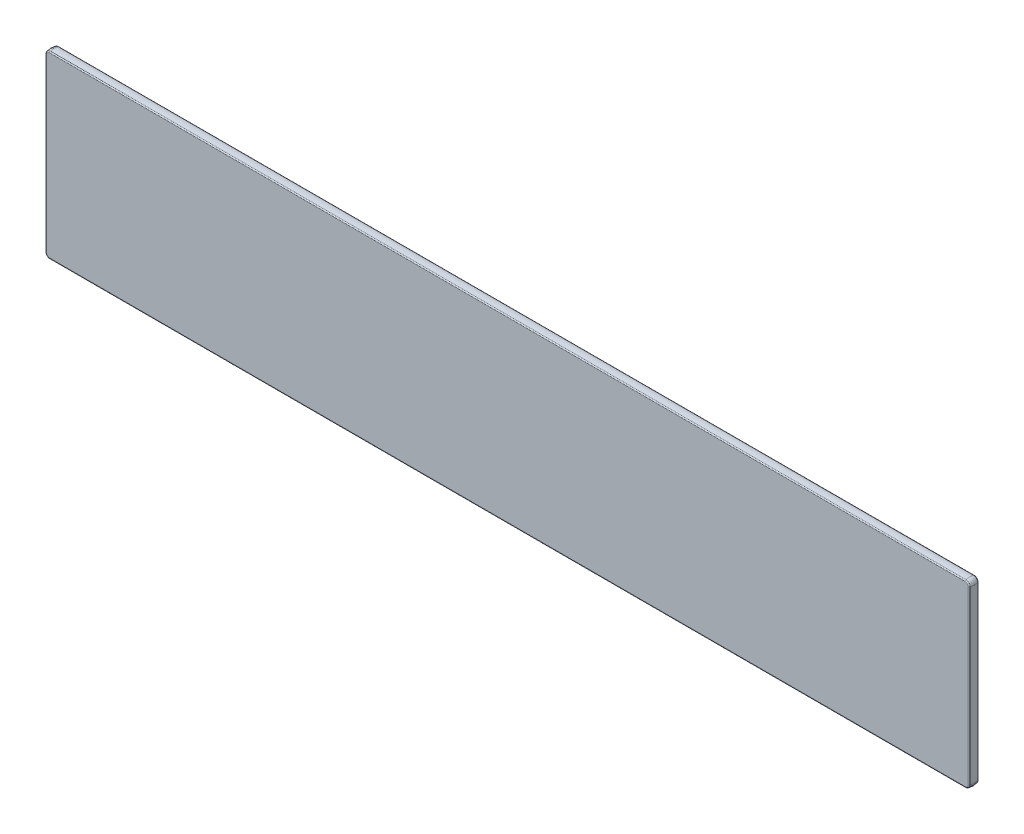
ISO-10303-21;
HEADER;
FILE_DESCRIPTION(('STEP AP214'),'2;1');
FILE_NAME('part.step','',(''),(''),'','','');
FILE_SCHEMA(('AUTOMOTIVE_DESIGN { 1 0 10303 214 1 1 1 1 }'));
ENDSEC;
DATA;
#1=APPLICATION_CONTEXT('core data for automotive mechanical design processes');
#2=APPLICATION_PROTOCOL_DEFINITION('international standard','automotive_design',2000,#1);
#3=PRODUCT_CONTEXT('',#1,'mechanical');
#4=PRODUCT('Part','Part','',(#3));
#5=PRODUCT_RELATED_PRODUCT_CATEGORY('part','',(#4));
#6=PRODUCT_DEFINITION_FORMATION('','',#4);
#7=PRODUCT_DEFINITION_CONTEXT('part definition',#1,'design');
#8=PRODUCT_DEFINITION('design','',#6,#7);
#9=PRODUCT_DEFINITION_SHAPE('','',#8);
#10=(LENGTH_UNIT() NAMED_UNIT(*) SI_UNIT(.MILLI.,.METRE.));
#11=(NAMED_UNIT(*) PLANE_ANGLE_UNIT() SI_UNIT($,.RADIAN.));
#12=(NAMED_UNIT(*) SI_UNIT($,.STERADIAN.) SOLID_ANGLE_UNIT());
#13=UNCERTAINTY_MEASURE_WITH_UNIT(LENGTH_MEASURE(1.E-05),#10,'distance_accuracy_value','');
#14=(GEOMETRIC_REPRESENTATION_CONTEXT(3) GLOBAL_UNCERTAINTY_ASSIGNED_CONTEXT((#13)) GLOBAL_UNIT_ASSIGNED_CONTEXT((#10,
#11,#12)) REPRESENTATION_CONTEXT('',''));
#15=CARTESIAN_POINT('',(0.,0.,0.));
#16=DIRECTION('',(0.,0.,1.));
#17=DIRECTION('',(1.,0.,0.));
#18=AXIS2_PLACEMENT_3D('',#15,#16,#17);
#19=CARTESIAN_POINT('',(-0.00101959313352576,-457.420684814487,265.128075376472));
#20=DIRECTION('',(-3.16923956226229E-08,3.73783141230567E-09,1.));
#21=DIRECTION('',(0.999999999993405,-3.63158778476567E-06,3.16924091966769E-08));
#22=AXIS2_PLACEMENT_3D('',#19,#20,#21);
#23=PLANE('',#22);
#24=DIRECTION('',(-3.63158778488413E-06,-0.999999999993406,3.73771631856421E-09));
#25=VECTOR('',#24,1.);
#26=CARTESIAN_POINT('',(196.323535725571,-457.421397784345,265.12808159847));
#27=LINE('',#26,#25);
#28=CARTESIAN_POINT('',(196.323668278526,-420.921397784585,265.128081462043));
#29=VERTEX_POINT('',#28);
#30=CARTESIAN_POINT('',(196.323403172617,-493.921397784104,265.128081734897));
#31=VERTEX_POINT('',#30);
#32=EDGE_CURVE('E209',#29,#31,#27,.T.);
#33=ORIENTED_EDGE('',*,*,#32,.F.);
#34=CARTESIAN_POINT('',(194.999117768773,-419.596837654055,265.128081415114));
#35=CARTESIAN_POINT('',(195.249588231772,-419.59683856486,265.128081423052));
#36=CARTESIAN_POINT('',(195.499293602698,-419.655786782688,265.128081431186));
#37=CARTESIAN_POINT('',(195.730272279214,-419.773775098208,265.128081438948));
#38=CARTESIAN_POINT('',(196.054168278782,-420.053386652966,265.128081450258));
#39=CARTESIAN_POINT('',(196.245568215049,-420.428356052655,265.128081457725));
#40=CARTESIAN_POINT('',(196.29763624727,-420.588831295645,265.128081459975));
#41=CARTESIAN_POINT('',(196.323668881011,-420.754945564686,265.128081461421));
#42=CARTESIAN_POINT('',(196.323668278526,-420.921397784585,265.128081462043));
#43=B_SPLINE_CURVE_WITH_KNOTS('',5,(#34,#35,#36,#37,#38,#39,#40,#41,#42),.UNSPECIFIED.,.F.,.F.,
(6,3,6),(0.,0.600759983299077,1.),.UNSPECIFIED.);
#44=CARTESIAN_POINT('',(194.999117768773,-419.596837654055,265.128081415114));
#45=VERTEX_POINT('',#44);
#46=EDGE_CURVE('E36',#45,#29,#43,.T.);
#47=ORIENTED_EDGE('',*,*,#46,.F.);
#48=DIRECTION('',(0.999999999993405,-3.63158778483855E-06,3.16924091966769E-08));
#49=VECTOR('',#48,1.);
#50=CARTESIAN_POINT('',(-0.000882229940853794,-419.596129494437,265.128075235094));
#51=LINE('',#50,#49);
#52=CARTESIAN_POINT('',(-195.000882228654,-419.595421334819,265.128069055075));
#53=VERTEX_POINT('',#52);
#54=EDGE_CURVE('E159',#53,#45,#51,.T.);
#55=ORIENTED_EDGE('',*,*,#54,.F.);
#56=CARTESIAN_POINT('',(-196.325442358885,-420.919971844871,265.128069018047));
#57=CARTESIAN_POINT('',(-196.325441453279,-420.669501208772,265.12806901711));
#58=CARTESIAN_POINT('',(-196.266492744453,-420.419796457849,265.128069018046));
#59=CARTESIAN_POINT('',(-196.148505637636,-420.188818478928,265.128069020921));
#60=CARTESIAN_POINT('',(-195.868894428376,-419.864922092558,265.128069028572));
#61=CARTESIAN_POINT('',(-195.493924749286,-419.673521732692,265.128069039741));
#62=CARTESIAN_POINT('',(-195.333449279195,-419.621453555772,265.128069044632));
#63=CARTESIAN_POINT('',(-195.167334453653,-419.595420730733,265.128069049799));
#64=CARTESIAN_POINT('',(-195.000882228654,-419.595421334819,265.128069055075));
#65=B_SPLINE_CURVE_WITH_KNOTS('',5,(#56,#57,#58,#59,#60,#61,#62,#63,#64),.UNSPECIFIED.,.F.,.F.,
(6,3,6),(0.,0.600760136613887,1.),.UNSPECIFIED.);
#66=CARTESIAN_POINT('',(-196.325442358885,-420.919971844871,265.128069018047));
#67=VERTEX_POINT('',#66);
#68=EDGE_CURVE('E157',#67,#53,#65,.T.);
#69=ORIENTED_EDGE('',*,*,#68,.F.);
#70=DIRECTION('',(3.63158778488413E-06,0.999999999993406,-3.73771631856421E-09));
#71=VECTOR('',#70,1.);
#72=CARTESIAN_POINT('',(-196.325574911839,-457.41997184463,265.128069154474));
#73=LINE('',#72,#71);
#74=CARTESIAN_POINT('',(-196.325707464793,-493.91997184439,265.1280692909));
#75=VERTEX_POINT('',#74);
#76=EDGE_CURVE('E191',#75,#67,#73,.T.);
#77=ORIENTED_EDGE('',*,*,#76,.F.);
#78=CARTESIAN_POINT('',(-195.00115695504,-495.24453197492,265.128069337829));
#79=CARTESIAN_POINT('',(-195.251627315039,-495.244531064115,265.128069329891));
#80=CARTESIAN_POINT('',(-195.501332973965,-495.185582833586,265.128069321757));
#81=CARTESIAN_POINT('',(-195.732311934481,-495.067594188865,265.128069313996));
#82=CARTESIAN_POINT('',(-196.056207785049,-494.787982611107,265.128069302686));
#83=CARTESIAN_POINT('',(-196.247607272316,-494.413013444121,265.128069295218));
#84=CARTESIAN_POINT('',(-196.299675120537,-494.252538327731,265.128069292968));
#85=CARTESIAN_POINT('',(-196.325708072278,-494.086423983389,265.128069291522));
#86=CARTESIAN_POINT('',(-196.325707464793,-493.91997184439,265.1280692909));
#87=B_SPLINE_CURVE_WITH_KNOTS('',5,(#78,#79,#80,#81,#82,#83,#84,#85,#86),.UNSPECIFIED.,.F.,.F.,
(6,3,6),(0.,0.600759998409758,1.),.UNSPECIFIED.);
#88=CARTESIAN_POINT('',(-195.00115695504,-495.24453197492,265.128069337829));
#89=VERTEX_POINT('',#88);
#90=EDGE_CURVE('E197',#89,#75,#87,.T.);
#91=ORIENTED_EDGE('',*,*,#90,.F.);
#92=DIRECTION('',(-0.999999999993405,3.63158778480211E-06,-3.16924091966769E-08));
#93=VECTOR('',#92,1.);
#94=CARTESIAN_POINT('',(-0.00115695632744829,-495.245240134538,265.128075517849));
#95=LINE('',#94,#93);
#96=CARTESIAN_POINT('',(194.998843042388,-495.245948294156,265.128081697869));
#97=VERTEX_POINT('',#96);
#98=EDGE_CURVE('E205',#97,#89,#95,.T.);
#99=ORIENTED_EDGE('',*,*,#98,.F.);
#100=CARTESIAN_POINT('',(196.323403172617,-493.921397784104,265.128081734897));
#101=CARTESIAN_POINT('',(196.323402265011,-494.171868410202,265.128081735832));
#102=CARTESIAN_POINT('',(196.264453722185,-494.421573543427,265.128081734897));
#103=CARTESIAN_POINT('',(196.146465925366,-494.652552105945,265.128081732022));
#104=CARTESIAN_POINT('',(195.866854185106,-494.976448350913,265.128081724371));
#105=CARTESIAN_POINT('',(195.491884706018,-495.16784818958,265.128081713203));
#106=CARTESIAN_POINT('',(195.331409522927,-495.219916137,265.128081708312));
#107=CARTESIAN_POINT('',(195.165295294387,-495.245948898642,265.128081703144));
#108=CARTESIAN_POINT('',(194.998843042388,-495.245948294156,265.128081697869));
#109=B_SPLINE_CURVE_WITH_KNOTS('',5,(#100,#101,#102,#103,#104,#105,#106,#107,#108),
.UNSPECIFIED.,.F.,.F.,(6,3,6),(0.,0.600760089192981,1.),.UNSPECIFIED.);
#110=EDGE_CURVE('E223',#31,#97,#109,.T.);
#111=ORIENTED_EDGE('',*,*,#110,.F.);
#112=EDGE_LOOP('',(#33,#47,#55,#69,#77,#91,#99,#111));
#113=FACE_BOUND('',#112,.T.);
#114=ADVANCED_FACE('F17',(#113),#23,.T.);
#115=CARTESIAN_POINT('',(-0.00101946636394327,-457.420684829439,261.128075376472));
#116=DIRECTION('',(-3.16923956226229E-08,3.73783141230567E-09,1.));
#117=DIRECTION('',(0.999999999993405,-3.63158778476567E-06,3.16924091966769E-08));
#118=AXIS2_PLACEMENT_3D('',#115,#116,#117);
#119=PLANE('',#118);
#120=CARTESIAN_POINT('',(196.323403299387,-493.921397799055,261.128081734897));
#121=CARTESIAN_POINT('',(196.323402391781,-494.171868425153,261.128081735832));
#122=CARTESIAN_POINT('',(196.264453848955,-494.421573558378,261.128081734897));
#123=CARTESIAN_POINT('',(196.146466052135,-494.652552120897,261.128081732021));
#124=CARTESIAN_POINT('',(195.866854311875,-494.976448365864,261.128081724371));
#125=CARTESIAN_POINT('',(195.491884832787,-495.167848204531,261.128081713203));
#126=CARTESIAN_POINT('',(195.331409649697,-495.219916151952,261.128081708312));
#127=CARTESIAN_POINT('',(195.165295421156,-495.245948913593,261.128081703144));
#128=CARTESIAN_POINT('',(194.998843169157,-495.245948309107,261.128081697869));
#129=B_SPLINE_CURVE_WITH_KNOTS('',5,(#120,#121,#122,#123,#124,#125,#126,#127,#128),
.UNSPECIFIED.,.F.,.F.,(6,3,6),(0.,0.600760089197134,1.),.UNSPECIFIED.);
#130=CARTESIAN_POINT('',(196.323403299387,-493.921397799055,261.128081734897));
#131=VERTEX_POINT('',#130);
#132=CARTESIAN_POINT('',(194.998843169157,-495.245948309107,261.128081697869));
#133=VERTEX_POINT('',#132);
#134=EDGE_CURVE('E11',#131,#133,#129,.T.);
#135=ORIENTED_EDGE('',*,*,#134,.T.);
#136=DIRECTION('',(-0.999999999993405,3.63158778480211E-06,-3.16924091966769E-08));
#137=VECTOR('',#136,1.);
#138=CARTESIAN_POINT('',(-0.0011568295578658,-495.245240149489,261.128075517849));
#139=LINE('',#138,#137);
#140=CARTESIAN_POINT('',(-195.001156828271,-495.244531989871,261.12806933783));
#141=VERTEX_POINT('',#140);
#142=EDGE_CURVE('E27',#133,#141,#139,.T.);
#143=ORIENTED_EDGE('',*,*,#142,.T.);
#144=CARTESIAN_POINT('',(-195.001156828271,-495.244531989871,261.12806933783));
#145=CARTESIAN_POINT('',(-195.251627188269,-495.244531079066,261.128069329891));
#146=CARTESIAN_POINT('',(-195.501332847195,-495.185582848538,261.128069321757));
#147=CARTESIAN_POINT('',(-195.732311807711,-495.067594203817,261.128069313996));
#148=CARTESIAN_POINT('',(-196.056207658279,-494.787982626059,261.128069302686));
#149=CARTESIAN_POINT('',(-196.247607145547,-494.413013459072,261.128069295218));
#150=CARTESIAN_POINT('',(-196.299674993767,-494.252538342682,261.128069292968));
#151=CARTESIAN_POINT('',(-196.325707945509,-494.08642399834,261.128069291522));
#152=CARTESIAN_POINT('',(-196.325707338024,-493.919971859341,261.1280692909));
#153=B_SPLINE_CURVE_WITH_KNOTS('',5,(#144,#145,#146,#147,#148,#149,#150,#151,#152),
.UNSPECIFIED.,.F.,.F.,(6,3,6),(0.,0.600759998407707,1.),.UNSPECIFIED.);
#154=CARTESIAN_POINT('',(-196.325707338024,-493.919971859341,261.1280692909));
#155=VERTEX_POINT('',#154);
#156=EDGE_CURVE('E325',#141,#155,#153,.T.);
#157=ORIENTED_EDGE('',*,*,#156,.T.);
#158=DIRECTION('',(3.63158778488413E-06,0.999999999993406,-3.73771631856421E-09));
#159=VECTOR('',#158,1.);
#160=CARTESIAN_POINT('',(-196.325574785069,-457.419971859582,261.128069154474));
#161=LINE('',#160,#159);
#162=CARTESIAN_POINT('',(-196.325442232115,-420.919971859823,261.128069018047));
#163=VERTEX_POINT('',#162);
#164=EDGE_CURVE('E318',#155,#163,#161,.T.);
#165=ORIENTED_EDGE('',*,*,#164,.T.);
#166=CARTESIAN_POINT('',(-196.325442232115,-420.919971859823,261.128069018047));
#167=CARTESIAN_POINT('',(-196.325441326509,-420.669501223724,261.12806901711));
#168=CARTESIAN_POINT('',(-196.266492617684,-420.4197964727,261.128069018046));
#169=CARTESIAN_POINT('',(-196.148505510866,-420.188818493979,261.128069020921));
#170=CARTESIAN_POINT('',(-195.868894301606,-419.864922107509,261.128069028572));
#171=CARTESIAN_POINT('',(-195.493924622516,-419.673521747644,261.128069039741));
#172=CARTESIAN_POINT('',(-195.333449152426,-419.621453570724,261.128069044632));
#173=CARTESIAN_POINT('',(-195.167334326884,-419.595420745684,261.128069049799));
#174=CARTESIAN_POINT('',(-195.000882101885,-419.59542134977,261.128069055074));
#175=B_SPLINE_CURVE_WITH_KNOTS('',5,(#166,#167,#168,#169,#170,#171,#172,#173,#174),
.UNSPECIFIED.,.F.,.F.,(6,3,6),(0.,0.600760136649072,1.),.UNSPECIFIED.);
#176=CARTESIAN_POINT('',(-195.000882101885,-419.59542134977,261.128069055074));
#177=VERTEX_POINT('',#176);
#178=EDGE_CURVE('E313',#163,#177,#175,.T.);
#179=ORIENTED_EDGE('',*,*,#178,.T.);
#180=DIRECTION('',(0.999999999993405,-3.63158778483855E-06,3.16924091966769E-08));
#181=VECTOR('',#180,1.);
#182=CARTESIAN_POINT('',(-0.000882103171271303,-419.596129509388,261.128075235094));
#183=LINE('',#182,#181);
#184=CARTESIAN_POINT('',(194.999117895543,-419.596837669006,261.128081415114));
#185=VERTEX_POINT('',#184);
#186=EDGE_CURVE('E306',#177,#185,#183,.T.);
#187=ORIENTED_EDGE('',*,*,#186,.T.);
#188=CARTESIAN_POINT('',(194.999117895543,-419.596837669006,261.128081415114));
#189=CARTESIAN_POINT('',(195.249588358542,-419.596838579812,261.128081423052));
#190=CARTESIAN_POINT('',(195.499293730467,-419.655786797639,261.128081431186));
#191=CARTESIAN_POINT('',(195.730272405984,-419.773775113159,261.128081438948));
#192=CARTESIAN_POINT('',(196.054168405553,-420.053386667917,261.128081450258));
#193=CARTESIAN_POINT('',(196.24556834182,-420.428356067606,261.128081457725));
#194=CARTESIAN_POINT('',(196.297636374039,-420.588831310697,261.128081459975));
#195=CARTESIAN_POINT('',(196.323669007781,-420.754945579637,261.128081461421));
#196=CARTESIAN_POINT('',(196.323668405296,-420.921397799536,261.128081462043));
#197=B_SPLINE_CURVE_WITH_KNOTS('',5,(#188,#189,#190,#191,#192,#193,#194,#195,#196),
.UNSPECIFIED.,.F.,.F.,(6,3,6),(0.,0.600759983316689,1.),.UNSPECIFIED.);
#198=CARTESIAN_POINT('',(196.323668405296,-420.921397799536,261.128081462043));
#199=VERTEX_POINT('',#198);
#200=EDGE_CURVE('E301',#185,#199,#197,.T.);
#201=ORIENTED_EDGE('',*,*,#200,.T.);
#202=DIRECTION('',(-3.63158778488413E-06,-0.999999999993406,3.73771631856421E-09));
#203=VECTOR('',#202,1.);
#204=CARTESIAN_POINT('',(196.323535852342,-457.421397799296,261.12808159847));
#205=LINE('',#204,#203);
#206=EDGE_CURVE('E249',#199,#131,#205,.T.);
#207=ORIENTED_EDGE('',*,*,#206,.T.);
#208=EDGE_LOOP('',(#135,#143,#157,#165,#179,#187,#201,#207));
#209=FACE_BOUND('',#208,.T.);
#210=ADVANCED_FACE('F409',(#209),#119,.F.);
#211=CARTESIAN_POINT('',(194.998843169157,-495.245948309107,261.128081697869));
#212=CARTESIAN_POINT('',(194.998841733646,-495.641233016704,261.128081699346));
#213=CARTESIAN_POINT('',(194.998841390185,-495.732452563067,261.512697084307));
#214=CARTESIAN_POINT('',(195.207348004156,-495.245949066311,261.128081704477));
#215=CARTESIAN_POINT('',(195.269300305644,-495.641234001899,261.128081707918));
#216=CARTESIAN_POINT('',(195.283596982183,-495.732453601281,261.512697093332));
#217=CARTESIAN_POINT('',(195.415243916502,-495.205100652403,261.128081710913));
#218=CARTESIAN_POINT('',(195.539506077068,-495.588248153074,261.128081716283));
#219=CARTESIAN_POINT('',(195.568181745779,-495.676666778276,261.512697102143));
#220=CARTESIAN_POINT('',(195.612181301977,-495.123463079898,261.128081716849));
#221=CARTESIAN_POINT('',(195.79540421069,-495.48206341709,261.128081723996));
#222=CARTESIAN_POINT('',(195.837686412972,-495.564817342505,261.512697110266));
#223=CARTESIAN_POINT('',(195.964269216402,-494.886811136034,261.128081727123));
#224=CARTESIAN_POINT('',(196.252374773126,-495.174915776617,261.128081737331));
#225=CARTESIAN_POINT('',(196.318860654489,-495.241401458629,261.512697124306));
#226=CARTESIAN_POINT('',(196.200909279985,-494.534738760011,261.128081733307));
#227=CARTESIAN_POINT('',(196.559506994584,-494.717965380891,261.128081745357));
#228=CARTESIAN_POINT('',(196.64226030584,-494.76024844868,261.512697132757));
#229=CARTESIAN_POINT('',(196.282550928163,-494.337806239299,261.128081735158));
#230=CARTESIAN_POINT('',(196.665696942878,-494.462073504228,261.128081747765));
#231=CARTESIAN_POINT('',(196.754115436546,-494.49075052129,261.512697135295));
#232=CARTESIAN_POINT('',(196.323402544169,-494.129906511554,261.128081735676));
#233=CARTESIAN_POINT('',(196.718687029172,-494.191862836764,261.128081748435));
#234=CARTESIAN_POINT('',(196.80990651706,-494.206160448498,261.512697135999));
#235=CARTESIAN_POINT('',(196.323403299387,-493.921397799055,261.128081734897));
#236=CARTESIAN_POINT('',(196.718688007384,-493.921399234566,261.128081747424));
#237=CARTESIAN_POINT('',(196.809907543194,-493.9213995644,261.512697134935));
#238=(BOUNDED_SURFACE() B_SPLINE_SURFACE(5,2,((#211,#212,#213),(#214,#215,#216),(#217,#218,
#219),(#220,#221,#222),(#223,#224,#225),(#226,#227,#228),(#229,#230,#231),(#232,#233,#234),
(#235,#236,#237)),.UNSPECIFIED.,.F.,.F.,.F.) B_SPLINE_SURFACE_WITH_KNOTS((6,3,6),(3,3),(0.,
0.499995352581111,1.),(0.,1.),
.UNSPECIFIED.) GEOMETRIC_REPRESENTATION_ITEM() RATIONAL_B_SPLINE_SURFACE(((1.,0.784464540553,
1.),(1.,0.784464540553,1.),(1.,0.784464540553,1.),(1.,0.784464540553,1.),(1.,0.784464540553,1.),
(1.,0.784464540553,1.),(1.,0.784464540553,1.),(1.,0.784464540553,1.),(1.,0.784464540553,1.))) REPRESENTATION_ITEM('') SURFACE());
#239=CARTESIAN_POINT('',(194.998843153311,-495.245948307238,261.628081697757));
#240=DIRECTION('',(0.999999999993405,-3.63158771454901E-06,3.16924980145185E-08));
#241=DIRECTION('',(-3.16924844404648E-08,3.73783141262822E-09,1.));
#242=AXIS2_PLACEMENT_3D('',#239,#240,#241);
#243=CIRCLE('',#242,0.499999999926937);
#244=CARTESIAN_POINT('',(194.998841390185,-495.732452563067,261.512697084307));
#245=VERTEX_POINT('',#244);
#246=EDGE_CURVE('E247',#245,#133,#243,.T.);
#247=CARTESIAN_POINT('',(196.323403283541,-493.921397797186,261.628081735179));
#248=DIRECTION('',(3.6315878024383E-06,0.999999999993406,-3.73773852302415E-09));
#249=DIRECTION('',(3.16923956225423E-08,-3.73785361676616E-09,-1.));
#250=AXIS2_PLACEMENT_3D('',#247,#248,#249);
#251=CIRCLE('',#250,0.500000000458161);
#252=CARTESIAN_POINT('',(196.809907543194,-493.9213995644,261.512697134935));
#253=VERTEX_POINT('',#252);
#254=EDGE_CURVE('E237',#253,#131,#251,.T.);
#255=CARTESIAN_POINT('',(196.809907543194,-493.9213995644,261.512697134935));
#256=CARTESIAN_POINT('',(196.80990651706,-494.206160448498,261.512697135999));
#257=CARTESIAN_POINT('',(196.754115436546,-494.49075052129,261.512697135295));
#258=CARTESIAN_POINT('',(196.64226030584,-494.76024844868,261.512697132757));
#259=CARTESIAN_POINT('',(196.318860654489,-495.241401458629,261.512697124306));
#260=CARTESIAN_POINT('',(195.837686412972,-495.564817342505,261.512697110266));
#261=CARTESIAN_POINT('',(195.568181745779,-495.676666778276,261.512697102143));
#262=CARTESIAN_POINT('',(195.283596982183,-495.732453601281,261.512697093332));
#263=CARTESIAN_POINT('',(194.998841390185,-495.732452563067,261.512697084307));
#264=B_SPLINE_CURVE_WITH_KNOTS('',5,(#255,#256,#257,#258,#259,#260,#261,#262,#263),
.UNSPECIFIED.,.F.,.F.,(6,3,6),(0.,0.50000464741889,1.),.UNSPECIFIED.);
#265=EDGE_CURVE('E246',#253,#245,#264,.T.);
#266=ORIENTED_EDGE('',*,*,#246,.T.);
#267=ORIENTED_EDGE('',*,*,#134,.F.);
#268=ORIENTED_EDGE('',*,*,#254,.F.);
#269=ORIENTED_EDGE('',*,*,#265,.T.);
#270=EDGE_LOOP('',(#266,#267,#268,#269));
#271=FACE_BOUND('',#270,.T.);
#272=ADVANCED_FACE('F435',(#271),#238,.T.);
#273=CARTESIAN_POINT('',(-195.001156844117,-495.244531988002,261.628069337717));
#274=DIRECTION('',(0.999999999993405,-3.63158785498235E-06,3.16923203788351E-08));
#275=DIRECTION('',(-3.1692306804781E-08,3.73783141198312E-09,1.));
#276=AXIS2_PLACEMENT_3D('',#273,#274,#275);
#277=CYLINDRICAL_SURFACE('',#276,0.499999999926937);
#278=CARTESIAN_POINT('',(-195.001156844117,-495.244531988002,261.628069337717));
#279=DIRECTION('',(0.999999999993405,-3.63158785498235E-06,3.16923203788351E-08));
#280=DIRECTION('',(-3.1692306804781E-08,3.73783141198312E-09,1.));
#281=AXIS2_PLACEMENT_3D('',#278,#279,#280);
#282=CIRCLE('',#281,0.499999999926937);
#283=CARTESIAN_POINT('',(-195.001158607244,-495.73103624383,261.512684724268));
#284=VERTEX_POINT('',#283);
#285=EDGE_CURVE('E243',#284,#141,#282,.T.);
#286=ORIENTED_EDGE('',*,*,#285,.T.);
#287=ORIENTED_EDGE('',*,*,#142,.F.);
#288=ORIENTED_EDGE('',*,*,#246,.F.);
#289=DIRECTION('',(-0.999999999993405,3.63158778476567E-06,-3.16924091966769E-08));
#290=VECTOR('',#289,1.);
#291=CARTESIAN_POINT('',(-0.00115860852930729,-495.731744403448,261.512690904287));
#292=LINE('',#291,#290);
#293=EDGE_CURVE('E240',#245,#284,#292,.T.);
#294=ORIENTED_EDGE('',*,*,#293,.T.);
#295=EDGE_LOOP('',(#286,#287,#288,#294));
#296=FACE_BOUND('',#295,.T.);
#297=ADVANCED_FACE('F431',(#296),#277,.T.);
#298=CARTESIAN_POINT('',(196.323403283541,-493.921397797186,261.628081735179));
#299=DIRECTION('',(3.6315878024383E-06,0.999999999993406,-3.73773852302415E-09));
#300=DIRECTION('',(3.16923956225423E-08,-3.73785361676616E-09,-1.));
#301=AXIS2_PLACEMENT_3D('',#298,#299,#300);
#302=CYLINDRICAL_SURFACE('',#301,0.500000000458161);
#303=ORIENTED_EDGE('',*,*,#254,.T.);
#304=ORIENTED_EDGE('',*,*,#206,.F.);
#305=CARTESIAN_POINT('',(196.323668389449,-420.921397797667,261.628081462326));
#306=DIRECTION('',(3.63158776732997E-06,0.999999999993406,-3.73769411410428E-09));
#307=DIRECTION('',(3.16923956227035E-08,-3.73780920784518E-09,-1.));
#308=AXIS2_PLACEMENT_3D('',#305,#306,#307);
#309=CIRCLE('',#308,0.500000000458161);
#310=CARTESIAN_POINT('',(196.810172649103,-420.921399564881,261.512696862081));
#311=VERTEX_POINT('',#310);
#312=EDGE_CURVE('E228',#311,#199,#309,.T.);
#313=ORIENTED_EDGE('',*,*,#312,.F.);
#314=DIRECTION('',(-3.63158778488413E-06,-0.999999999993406,3.73771631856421E-09));
#315=VECTOR('',#314,1.);
#316=CARTESIAN_POINT('',(196.810040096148,-457.421399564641,261.512696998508));
#317=LINE('',#316,#315);
#318=EDGE_CURVE('E235',#311,#253,#317,.T.);
#319=ORIENTED_EDGE('',*,*,#318,.T.);
#320=EDGE_LOOP('',(#303,#304,#313,#319));
#321=FACE_BOUND('',#320,.T.);
#322=ADVANCED_FACE('F405',(#321),#302,.T.);
#323=CARTESIAN_POINT('',(-196.325707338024,-493.919971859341,261.1280692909));
#324=CARTESIAN_POINT('',(-196.720992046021,-493.91997042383,261.128069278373));
#325=CARTESIAN_POINT('',(-196.81221160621,-493.919970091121,261.512684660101));
#326=CARTESIAN_POINT('',(-196.325708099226,-494.12847662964,261.12806929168));
#327=CARTESIAN_POINT('',(-196.720993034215,-494.190428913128,261.128069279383));
#328=CARTESIAN_POINT('',(-196.812212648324,-494.204725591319,261.512684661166));
#329=CARTESIAN_POINT('',(-196.28485935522,-494.336372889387,261.128069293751));
#330=CARTESIAN_POINT('',(-196.668006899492,-494.460634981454,261.128069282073));
#331=CARTESIAN_POINT('',(-196.75642562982,-494.489310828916,261.512684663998));
#332=CARTESIAN_POINT('',(-196.203222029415,-494.533310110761,261.128069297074));
#333=CARTESIAN_POINT('',(-196.561822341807,-494.716533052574,261.128069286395));
#334=CARTESIAN_POINT('',(-196.644576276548,-494.758815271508,261.51268466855));
#335=CARTESIAN_POINT('',(-195.96657025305,-494.885397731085,261.128069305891));
#336=CARTESIAN_POINT('',(-196.254674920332,-495.17350323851,261.128069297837));
#337=CARTESIAN_POINT('',(-196.321160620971,-495.239989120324,261.512684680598));
#338=CARTESIAN_POINT('',(-195.614498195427,-495.122037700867,261.128069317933));
#339=CARTESIAN_POINT('',(-195.797724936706,-495.480635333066,261.128069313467));
#340=CARTESIAN_POINT('',(-195.840008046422,-495.563388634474,261.512684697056));
#341=CARTESIAN_POINT('',(-195.417565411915,-495.203679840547,261.128069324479));
#342=CARTESIAN_POINT('',(-195.541832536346,-495.586826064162,261.128069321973));
#343=CARTESIAN_POINT('',(-195.570509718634,-495.675244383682,261.512684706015));
#344=CARTESIAN_POINT('',(-195.209665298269,-495.244531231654,261.128069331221));
#345=CARTESIAN_POINT('',(-195.271621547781,-495.639815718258,261.128069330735));
#346=CARTESIAN_POINT('',(-195.285919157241,-495.731035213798,261.512684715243));
#347=CARTESIAN_POINT('',(-195.001156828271,-495.244531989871,261.12806933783));
#348=CARTESIAN_POINT('',(-195.001158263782,-495.639816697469,261.128069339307));
#349=CARTESIAN_POINT('',(-195.001158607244,-495.73103624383,261.512684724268));
#350=(BOUNDED_SURFACE() B_SPLINE_SURFACE(5,2,((#323,#324,#325),(#326,#327,#328),(#329,#330,
#331),(#332,#333,#334),(#335,#336,#337),(#338,#339,#340),(#341,#342,#343),(#344,#345,#346),
(#347,#348,#349)),.UNSPECIFIED.,.F.,.F.,.F.) B_SPLINE_SURFACE_WITH_KNOTS((6,3,6),(3,3),(0.,
0.499995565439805,1.),(0.,1.),
.UNSPECIFIED.) GEOMETRIC_REPRESENTATION_ITEM() RATIONAL_B_SPLINE_SURFACE(((1.,0.784464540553,
1.),(1.,0.784464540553,1.),(1.,0.784464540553,1.),(1.,0.784464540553,1.),(1.,0.784464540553,1.),
(1.,0.784464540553,1.),(1.,0.784464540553,1.),(1.,0.784464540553,1.),(1.,0.784464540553,1.))) REPRESENTATION_ITEM('') SURFACE());
#351=CARTESIAN_POINT('',(-196.32570735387,-493.919971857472,261.628069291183));
#352=DIRECTION('',(-3.63158776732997E-06,-0.999999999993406,3.73773852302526E-09));
#353=DIRECTION('',(-3.16923956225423E-08,3.73785361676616E-09,1.));
#354=AXIS2_PLACEMENT_3D('',#351,#352,#353);
#355=CIRCLE('',#354,0.500000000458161);
#356=CARTESIAN_POINT('',(-196.81221160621,-493.919970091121,261.512684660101));
#357=VERTEX_POINT('',#356);
#358=EDGE_CURVE('E232',#357,#155,#355,.T.);
#359=CARTESIAN_POINT('',(-195.001158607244,-495.73103624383,261.512684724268));
#360=CARTESIAN_POINT('',(-195.285919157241,-495.731035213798,261.512684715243));
#361=CARTESIAN_POINT('',(-195.570509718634,-495.675244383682,261.512684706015));
#362=CARTESIAN_POINT('',(-195.840008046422,-495.563388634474,261.512684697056));
#363=CARTESIAN_POINT('',(-196.321160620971,-495.239989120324,261.512684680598));
#364=CARTESIAN_POINT('',(-196.644576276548,-494.758815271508,261.51268466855));
#365=CARTESIAN_POINT('',(-196.75642562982,-494.489310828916,261.512684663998));
#366=CARTESIAN_POINT('',(-196.812212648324,-494.204725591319,261.512684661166));
#367=CARTESIAN_POINT('',(-196.81221160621,-493.919970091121,261.512684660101));
#368=B_SPLINE_CURVE_WITH_KNOTS('',5,(#359,#360,#361,#362,#363,#364,#365,#366,#367),
.UNSPECIFIED.,.F.,.F.,(6,3,6),(0.,0.500004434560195,1.),.UNSPECIFIED.);
#369=EDGE_CURVE('E231',#284,#357,#368,.T.);
#370=ORIENTED_EDGE('',*,*,#358,.T.);
#371=ORIENTED_EDGE('',*,*,#156,.F.);
#372=ORIENTED_EDGE('',*,*,#285,.F.);
#373=ORIENTED_EDGE('',*,*,#369,.T.);
#374=EDGE_LOOP('',(#370,#371,#372,#373));
#375=FACE_BOUND('',#374,.T.);
#376=ADVANCED_FACE('F425',(#375),#350,.T.);
#377=CARTESIAN_POINT('',(196.323668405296,-420.921397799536,261.128081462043));
#378=CARTESIAN_POINT('',(196.718953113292,-420.921399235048,261.128081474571));
#379=CARTESIAN_POINT('',(196.810172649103,-420.921399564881,261.512696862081));
#380=CARTESIAN_POINT('',(196.323669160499,-420.712893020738,261.128081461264));
#381=CARTESIAN_POINT('',(196.718954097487,-420.650940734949,261.12808147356));
#382=CARTESIAN_POINT('',(196.810173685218,-420.636644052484,261.512696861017));
#383=CARTESIAN_POINT('',(196.282820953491,-420.504997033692,261.128081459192));
#384=CARTESIAN_POINT('',(196.665968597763,-420.380735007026,261.12808147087));
#385=CARTESIAN_POINT('',(196.754387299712,-420.352059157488,261.512696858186));
#386=CARTESIAN_POINT('',(196.201183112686,-420.308059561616,261.128081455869));
#387=CARTESIAN_POINT('',(196.559783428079,-420.124836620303,261.128081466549));
#388=CARTESIAN_POINT('',(196.642537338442,-420.082554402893,261.512696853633));
#389=CARTESIAN_POINT('',(195.964531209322,-419.955971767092,261.128081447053));
#390=CARTESIAN_POINT('',(196.252635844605,-419.667866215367,261.128081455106));
#391=CARTESIAN_POINT('',(196.319121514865,-419.601380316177,261.512696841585));
#392=CARTESIAN_POINT('',(195.612458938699,-419.719331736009,261.12808143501));
#393=CARTESIAN_POINT('',(195.79568558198,-419.36073403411,261.128081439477));
#394=CARTESIAN_POINT('',(195.837968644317,-419.277980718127,261.512696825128));
#395=CARTESIAN_POINT('',(195.415526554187,-419.637689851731,261.128081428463));
#396=CARTESIAN_POINT('',(195.539793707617,-419.254543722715,261.12808143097));
#397=CARTESIAN_POINT('',(195.568470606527,-419.16612537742,261.512696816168));
#398=CARTESIAN_POINT('',(195.207626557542,-419.596838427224,261.128081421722));
#399=CARTESIAN_POINT('',(195.269582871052,-419.201553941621,261.128081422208));
#400=CARTESIAN_POINT('',(195.283880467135,-419.110334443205,261.51269680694));
#401=CARTESIAN_POINT('',(194.999117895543,-419.596837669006,261.128081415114));
#402=CARTESIAN_POINT('',(194.999119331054,-419.201552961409,261.128081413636));
#403=CARTESIAN_POINT('',(194.999119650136,-419.110333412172,261.512696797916));
#404=(BOUNDED_SURFACE() B_SPLINE_SURFACE(5,2,((#377,#378,#379),(#380,#381,#382),(#383,#384,
#385),(#386,#387,#388),(#389,#390,#391),(#392,#393,#394),(#395,#396,#397),(#398,#399,#400),
(#401,#402,#403)),.UNSPECIFIED.,.F.,.F.,.F.) B_SPLINE_SURFACE_WITH_KNOTS((6,3,6),(3,3),(0.,
0.499995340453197,1.),(0.,1.),
.UNSPECIFIED.) GEOMETRIC_REPRESENTATION_ITEM() RATIONAL_B_SPLINE_SURFACE(((1.,0.784464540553,
1.),(1.,0.784464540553,1.),(1.,0.784464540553,1.),(1.,0.784464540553,1.),(1.,0.784464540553,1.),
(1.,0.784464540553,1.),(1.,0.784464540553,1.),(1.,0.784464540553,1.),(1.,0.784464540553,1.))) REPRESENTATION_ITEM('') SURFACE());
#405=CARTESIAN_POINT('',(194.999117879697,-419.596837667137,261.628081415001));
#406=DIRECTION('',(-0.999999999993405,3.63158785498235E-06,-3.1692498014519E-08));
#407=DIRECTION('',(3.16924844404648E-08,-3.73783141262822E-09,-1.));
#408=AXIS2_PLACEMENT_3D('',#405,#406,#407);
#409=CIRCLE('',#408,0.499999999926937);
#410=CARTESIAN_POINT('',(194.999119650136,-419.110333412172,261.512696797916));
#411=VERTEX_POINT('',#410);
#412=EDGE_CURVE('E214',#411,#185,#409,.T.);
#413=CARTESIAN_POINT('',(194.999119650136,-419.110333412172,261.512696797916));
#414=CARTESIAN_POINT('',(195.283880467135,-419.110334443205,261.51269680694));
#415=CARTESIAN_POINT('',(195.568470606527,-419.16612537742,261.512696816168));
#416=CARTESIAN_POINT('',(195.837968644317,-419.277980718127,261.512696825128));
#417=CARTESIAN_POINT('',(196.319121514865,-419.601380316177,261.512696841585));
#418=CARTESIAN_POINT('',(196.642537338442,-420.082554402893,261.512696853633));
#419=CARTESIAN_POINT('',(196.754387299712,-420.352059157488,261.512696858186));
#420=CARTESIAN_POINT('',(196.810173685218,-420.636644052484,261.512696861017));
#421=CARTESIAN_POINT('',(196.810172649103,-420.921399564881,261.512696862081));
#422=B_SPLINE_CURVE_WITH_KNOTS('',5,(#413,#414,#415,#416,#417,#418,#419,#420,#421),
.UNSPECIFIED.,.F.,.F.,(6,3,6),(0.,0.500004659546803,1.),.UNSPECIFIED.);
#423=EDGE_CURVE('E227',#411,#311,#422,.T.);
#424=ORIENTED_EDGE('',*,*,#312,.T.);
#425=ORIENTED_EDGE('',*,*,#200,.F.);
#426=ORIENTED_EDGE('',*,*,#412,.F.);
#427=ORIENTED_EDGE('',*,*,#423,.T.);
#428=EDGE_LOOP('',(#424,#425,#426,#427));
#429=FACE_BOUND('',#428,.T.);
#430=ADVANCED_FACE('F403',(#429),#404,.T.);
#431=CARTESIAN_POINT('',(194.998841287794,-495.73245255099,264.743466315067));
#432=CARTESIAN_POINT('',(194.998841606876,-495.641233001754,265.128081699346));
#433=CARTESIAN_POINT('',(194.998843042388,-495.245948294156,265.128081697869));
#434=CARTESIAN_POINT('',(195.283596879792,-495.732453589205,264.743466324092));
#435=CARTESIAN_POINT('',(195.269300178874,-495.641233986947,265.128081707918));
#436=CARTESIAN_POINT('',(195.207347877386,-495.24594905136,265.128081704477));
#437=CARTESIAN_POINT('',(195.568181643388,-495.6766667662,264.743466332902));
#438=CARTESIAN_POINT('',(195.539505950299,-495.588248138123,265.128081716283));
#439=CARTESIAN_POINT('',(195.415243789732,-495.205100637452,265.128081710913));
#440=CARTESIAN_POINT('',(195.837686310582,-495.564817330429,264.743466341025));
#441=CARTESIAN_POINT('',(195.79540408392,-495.482063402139,265.128081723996));
#442=CARTESIAN_POINT('',(195.612181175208,-495.123463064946,265.128081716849));
#443=CARTESIAN_POINT('',(196.318860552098,-495.241401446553,264.743466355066));
#444=CARTESIAN_POINT('',(196.252374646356,-495.174915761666,265.128081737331));
#445=CARTESIAN_POINT('',(195.964269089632,-494.886811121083,265.128081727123));
#446=CARTESIAN_POINT('',(196.642260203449,-494.760248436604,264.743466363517));
#447=CARTESIAN_POINT('',(196.559506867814,-494.717965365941,265.128081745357));
#448=CARTESIAN_POINT('',(196.200909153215,-494.53473874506,265.128081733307));
#449=CARTESIAN_POINT('',(196.754115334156,-494.490750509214,264.743466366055));
#450=CARTESIAN_POINT('',(196.665696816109,-494.462073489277,265.128081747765));
#451=CARTESIAN_POINT('',(196.282550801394,-494.337806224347,265.128081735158));
#452=CARTESIAN_POINT('',(196.80990641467,-494.206160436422,264.743466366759));
#453=CARTESIAN_POINT('',(196.718686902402,-494.191862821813,265.128081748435));
#454=CARTESIAN_POINT('',(196.3234024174,-494.129906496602,265.128081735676));
#455=CARTESIAN_POINT('',(196.809907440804,-493.921399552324,264.743466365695));
#456=CARTESIAN_POINT('',(196.718687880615,-493.921399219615,265.128081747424));
#457=CARTESIAN_POINT('',(196.323403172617,-493.921397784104,265.128081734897));
#458=(BOUNDED_SURFACE() B_SPLINE_SURFACE(5,2,((#431,#432,#433),(#434,#435,#436),(#437,#438,
#439),(#440,#441,#442),(#443,#444,#445),(#446,#447,#448),(#449,#450,#451),(#452,#453,#454),
(#455,#456,#457)),.UNSPECIFIED.,.F.,.F.,.F.) B_SPLINE_SURFACE_WITH_KNOTS((6,3,6),(3,3),(0.,
0.499995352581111,1.),(0.,1.),
.UNSPECIFIED.) GEOMETRIC_REPRESENTATION_ITEM() RATIONAL_B_SPLINE_SURFACE(((1.,0.784464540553,
1.),(1.,0.784464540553,1.),(1.,0.784464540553,1.),(1.,0.784464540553,1.),(1.,0.784464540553,1.),
(1.,0.784464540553,1.),(1.,0.784464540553,1.),(1.,0.784464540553,1.),(1.,0.784464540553,1.))) REPRESENTATION_ITEM('') SURFACE());
#459=CARTESIAN_POINT('',(194.998843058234,-495.245948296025,264.628081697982));
#460=DIRECTION('',(0.999999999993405,-3.63158771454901E-06,3.16923203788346E-08));
#461=DIRECTION('',(-3.1692306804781E-08,3.73783141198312E-09,1.));
#462=AXIS2_PLACEMENT_3D('',#459,#460,#461);
#463=CIRCLE('',#462,0.499999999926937);
#464=CARTESIAN_POINT('',(194.998841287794,-495.73245255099,264.743466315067));
#465=VERTEX_POINT('',#464);
#466=EDGE_CURVE('E224',#97,#465,#463,.T.);
#467=CARTESIAN_POINT('',(196.809907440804,-493.921399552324,264.743466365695));
#468=CARTESIAN_POINT('',(196.80990641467,-494.206160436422,264.743466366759));
#469=CARTESIAN_POINT('',(196.754115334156,-494.490750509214,264.743466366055));
#470=CARTESIAN_POINT('',(196.642260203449,-494.760248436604,264.743466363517));
#471=CARTESIAN_POINT('',(196.318860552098,-495.241401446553,264.743466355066));
#472=CARTESIAN_POINT('',(195.837686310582,-495.564817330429,264.743466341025));
#473=CARTESIAN_POINT('',(195.568181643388,-495.6766667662,264.743466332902));
#474=CARTESIAN_POINT('',(195.283596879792,-495.732453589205,264.743466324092));
#475=CARTESIAN_POINT('',(194.998841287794,-495.73245255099,264.743466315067));
#476=B_SPLINE_CURVE_WITH_KNOTS('',5,(#467,#468,#469,#470,#471,#472,#473,#474,#475),
.UNSPECIFIED.,.F.,.F.,(6,3,6),(0.,0.50000464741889,1.),.UNSPECIFIED.);
#477=CARTESIAN_POINT('',(196.809907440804,-493.921399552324,264.743466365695));
#478=VERTEX_POINT('',#477);
#479=EDGE_CURVE('E173',#478,#465,#476,.T.);
#480=CARTESIAN_POINT('',(196.323403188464,-493.921397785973,264.628081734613));
#481=DIRECTION('',(3.6315878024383E-06,0.999999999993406,-3.73769411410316E-09));
#482=DIRECTION('',(3.16923956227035E-08,-3.73780920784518E-09,-1.));
#483=AXIS2_PLACEMENT_3D('',#480,#481,#482);
#484=CIRCLE('',#483,0.500000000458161);
#485=EDGE_CURVE('E210',#31,#478,#484,.T.);
#486=ORIENTED_EDGE('',*,*,#466,.T.);
#487=ORIENTED_EDGE('',*,*,#479,.F.);
#488=ORIENTED_EDGE('',*,*,#485,.F.);
#489=ORIENTED_EDGE('',*,*,#110,.T.);
#490=EDGE_LOOP('',(#486,#487,#488,#489));
#491=FACE_BOUND('',#490,.T.);
#492=ADVANCED_FACE('F388',(#491),#458,.T.);
#493=CARTESIAN_POINT('',(-196.325442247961,-420.919971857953,261.62806901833));
#494=DIRECTION('',(-3.6315878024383E-06,-0.999999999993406,3.73769411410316E-09));
#495=DIRECTION('',(-3.16923956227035E-08,3.73780920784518E-09,1.));
#496=AXIS2_PLACEMENT_3D('',#493,#494,#495);
#497=CYLINDRICAL_SURFACE('',#496,0.500000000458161);
#498=CARTESIAN_POINT('',(-196.325442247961,-420.919971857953,261.62806901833));
#499=DIRECTION('',(-3.6315878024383E-06,-0.999999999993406,3.73769411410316E-09));
#500=DIRECTION('',(-3.16923956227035E-08,3.73780920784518E-09,1.));
#501=AXIS2_PLACEMENT_3D('',#498,#499,#500);
#502=CIRCLE('',#501,0.500000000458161);
#503=CARTESIAN_POINT('',(-196.811946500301,-420.919970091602,261.512684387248));
#504=VERTEX_POINT('',#503);
#505=EDGE_CURVE('E220',#504,#163,#502,.T.);
#506=ORIENTED_EDGE('',*,*,#505,.T.);
#507=ORIENTED_EDGE('',*,*,#164,.F.);
#508=ORIENTED_EDGE('',*,*,#358,.F.);
#509=DIRECTION('',(3.63158778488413E-06,0.999999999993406,-3.73771631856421E-09));
#510=VECTOR('',#509,1.);
#511=CARTESIAN_POINT('',(-196.812079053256,-457.419970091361,261.512684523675));
#512=LINE('',#511,#510);
#513=EDGE_CURVE('E217',#357,#504,#512,.T.);
#514=ORIENTED_EDGE('',*,*,#513,.T.);
#515=EDGE_LOOP('',(#506,#507,#508,#514));
#516=FACE_BOUND('',#515,.T.);
#517=ADVANCED_FACE('F418',(#516),#497,.T.);
#518=CARTESIAN_POINT('',(194.999117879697,-419.596837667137,261.628081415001));
#519=DIRECTION('',(-0.999999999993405,3.63158785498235E-06,-3.1692498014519E-08));
#520=DIRECTION('',(3.16924844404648E-08,-3.73783141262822E-09,-1.));
#521=AXIS2_PLACEMENT_3D('',#518,#519,#520);
#522=CYLINDRICAL_SURFACE('',#521,0.499999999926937);
#523=ORIENTED_EDGE('',*,*,#412,.T.);
#524=ORIENTED_EDGE('',*,*,#186,.F.);
#525=CARTESIAN_POINT('',(-195.000882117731,-419.595421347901,261.628069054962));
#526=DIRECTION('',(-0.999999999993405,3.63158771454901E-06,-3.16923203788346E-08));
#527=DIRECTION('',(3.1692306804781E-08,-3.73783141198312E-09,-1.));
#528=AXIS2_PLACEMENT_3D('',#525,#526,#527);
#529=CIRCLE('',#528,0.499999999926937);
#530=CARTESIAN_POINT('',(-195.000880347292,-419.108917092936,261.512684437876));
#531=VERTEX_POINT('',#530);
#532=EDGE_CURVE('E202',#531,#177,#529,.T.);
#533=ORIENTED_EDGE('',*,*,#532,.F.);
#534=DIRECTION('',(0.999999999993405,-3.63158778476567E-06,3.16924091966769E-08));
#535=VECTOR('',#534,1.);
#536=CARTESIAN_POINT('',(-0.000880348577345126,-419.109625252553,261.512690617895));
#537=LINE('',#536,#535);
#538=EDGE_CURVE('E163',#531,#411,#537,.T.);
#539=ORIENTED_EDGE('',*,*,#538,.T.);
#540=EDGE_LOOP('',(#523,#524,#533,#539));
#541=FACE_BOUND('',#540,.T.);
#542=ADVANCED_FACE('F412',(#541),#522,.T.);
#543=CARTESIAN_POINT('',(196.323403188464,-493.921397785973,264.628081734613));
#544=DIRECTION('',(3.6315878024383E-06,0.999999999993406,-3.73769411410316E-09));
#545=DIRECTION('',(3.16923956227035E-08,-3.73780920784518E-09,-1.));
#546=AXIS2_PLACEMENT_3D('',#543,#544,#545);
#547=CYLINDRICAL_SURFACE('',#546,0.500000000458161);
#548=ORIENTED_EDGE('',*,*,#485,.T.);
#549=DIRECTION('',(-3.63158778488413E-06,-0.999999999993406,3.73771631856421E-09));
#550=VECTOR('',#549,1.);
#551=CARTESIAN_POINT('',(196.810039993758,-457.421399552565,264.743466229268));
#552=LINE('',#551,#550);
#553=CARTESIAN_POINT('',(196.810172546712,-420.921399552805,264.743466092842));
#554=VERTEX_POINT('',#553);
#555=EDGE_CURVE('E183',#554,#478,#552,.T.);
#556=ORIENTED_EDGE('',*,*,#555,.F.);
#557=CARTESIAN_POINT('',(196.323668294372,-420.921397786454,264.62808146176));
#558=DIRECTION('',(3.63158776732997E-06,0.999999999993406,-3.73773852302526E-09));
#559=DIRECTION('',(3.16923956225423E-08,-3.73785361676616E-09,-1.));
#560=AXIS2_PLACEMENT_3D('',#557,#558,#559);
#561=CIRCLE('',#560,0.500000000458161);
#562=EDGE_CURVE('E195',#29,#554,#561,.T.);
#563=ORIENTED_EDGE('',*,*,#562,.F.);
#564=ORIENTED_EDGE('',*,*,#32,.T.);
#565=EDGE_LOOP('',(#548,#556,#563,#564));
#566=FACE_BOUND('',#565,.T.);
#567=ADVANCED_FACE('F381',(#566),#547,.T.);
#568=CARTESIAN_POINT('',(-195.001156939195,-495.244531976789,264.628069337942));
#569=DIRECTION('',(0.999999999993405,-3.63158785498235E-06,3.1692498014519E-08));
#570=DIRECTION('',(-3.16924844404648E-08,3.73783141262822E-09,1.));
#571=AXIS2_PLACEMENT_3D('',#568,#569,#570);
#572=CYLINDRICAL_SURFACE('',#571,0.499999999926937);
#573=CARTESIAN_POINT('',(-195.001156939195,-495.244531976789,264.628069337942));
#574=DIRECTION('',(0.999999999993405,-3.63158785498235E-06,3.1692498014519E-08));
#575=DIRECTION('',(-3.16924844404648E-08,3.73783141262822E-09,1.));
#576=AXIS2_PLACEMENT_3D('',#573,#574,#575);
#577=CIRCLE('',#576,0.499999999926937);
#578=CARTESIAN_POINT('',(-195.001158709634,-495.731036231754,264.743453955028));
#579=VERTEX_POINT('',#578);
#580=EDGE_CURVE('E206',#89,#579,#577,.T.);
#581=ORIENTED_EDGE('',*,*,#580,.T.);
#582=DIRECTION('',(-0.999999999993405,3.63158778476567E-06,-3.16924091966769E-08));
#583=VECTOR('',#582,1.);
#584=CARTESIAN_POINT('',(-0.00115871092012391,-495.731744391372,264.743460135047));
#585=LINE('',#584,#583);
#586=EDGE_CURVE('E177',#465,#579,#585,.T.);
#587=ORIENTED_EDGE('',*,*,#586,.F.);
#588=ORIENTED_EDGE('',*,*,#466,.F.);
#589=ORIENTED_EDGE('',*,*,#98,.T.);
#590=EDGE_LOOP('',(#581,#587,#588,#589));
#591=FACE_BOUND('',#590,.T.);
#592=ADVANCED_FACE('F498',(#591),#572,.T.);
#593=CARTESIAN_POINT('',(-195.000882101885,-419.59542134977,261.128069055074));
#594=CARTESIAN_POINT('',(-195.000880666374,-419.200136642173,261.128069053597));
#595=CARTESIAN_POINT('',(-195.000880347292,-419.108917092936,261.512684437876));
#596=CARTESIAN_POINT('',(-195.209386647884,-419.595420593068,261.128069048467));
#597=CARTESIAN_POINT('',(-195.271338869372,-419.20013565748,261.128069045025));
#598=CARTESIAN_POINT('',(-195.28563554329,-419.108916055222,261.512684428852));
#599=CARTESIAN_POINT('',(-195.41728339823,-419.636269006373,261.128069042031));
#600=CARTESIAN_POINT('',(-195.541545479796,-419.253121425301,261.12806903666));
#601=CARTESIAN_POINT('',(-195.570221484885,-419.164702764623,261.512684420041));
#602=CARTESIAN_POINT('',(-195.614220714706,-419.717906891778,261.128069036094));
#603=CARTESIAN_POINT('',(-195.797443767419,-419.359306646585,261.128069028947));
#604=CARTESIAN_POINT('',(-195.83972602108,-419.276552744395,261.512684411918));
#605=CARTESIAN_POINT('',(-195.966308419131,-419.954558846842,261.12806902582));
#606=CARTESIAN_POINT('',(-196.254414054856,-419.666454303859,261.128069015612));
#607=CARTESIAN_POINT('',(-196.320899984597,-419.599968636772,261.512684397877));
#608=CARTESIAN_POINT('',(-196.202948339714,-420.306631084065,261.128069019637));
#609=CARTESIAN_POINT('',(-196.561546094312,-420.123404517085,261.128069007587));
#610=CARTESIAN_POINT('',(-196.644299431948,-420.081121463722,261.512684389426));
#611=CARTESIAN_POINT('',(-196.284589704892,-420.503563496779,261.128069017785));
#612=CARTESIAN_POINT('',(-196.667735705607,-420.37929631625,261.128069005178));
#613=CARTESIAN_POINT('',(-196.756154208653,-420.350619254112,261.512684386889));
#614=CARTESIAN_POINT('',(-196.325441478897,-420.711463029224,261.128069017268));
#615=CARTESIAN_POINT('',(-196.720725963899,-420.649506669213,261.128069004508));
#616=CARTESIAN_POINT('',(-196.811945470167,-420.635209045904,261.512684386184));
#617=CARTESIAN_POINT('',(-196.325442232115,-420.919971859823,261.128069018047));
#618=CARTESIAN_POINT('',(-196.720726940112,-420.919970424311,261.128069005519));
#619=CARTESIAN_POINT('',(-196.811946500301,-420.919970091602,261.512684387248));
#620=(BOUNDED_SURFACE() B_SPLINE_SURFACE(5,2,((#593,#594,#595),(#596,#597,#598),(#599,#600,
#601),(#602,#603,#604),(#605,#606,#607),(#608,#609,#610),(#611,#612,#613),(#614,#615,#616),
(#617,#618,#619)),.UNSPECIFIED.,.F.,.F.,.F.) B_SPLINE_SURFACE_WITH_KNOTS((6,3,6),(3,3),(0.,
0.499994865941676,1.),(0.,1.),
.UNSPECIFIED.) GEOMETRIC_REPRESENTATION_ITEM() RATIONAL_B_SPLINE_SURFACE(((1.,0.784464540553,
1.),(1.,0.784464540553,1.),(1.,0.784464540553,1.),(1.,0.784464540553,1.),(1.,0.784464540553,1.),
(1.,0.784464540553,1.),(1.,0.784464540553,1.),(1.,0.784464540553,1.),(1.,0.784464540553,1.))) REPRESENTATION_ITEM('') SURFACE());
#621=CARTESIAN_POINT('',(-196.811946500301,-420.919970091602,261.512684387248));
#622=CARTESIAN_POINT('',(-196.811945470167,-420.635209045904,261.512684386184));
#623=CARTESIAN_POINT('',(-196.756154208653,-420.350619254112,261.512684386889));
#624=CARTESIAN_POINT('',(-196.644299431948,-420.081121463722,261.512684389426));
#625=CARTESIAN_POINT('',(-196.320899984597,-419.599968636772,261.512684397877));
#626=CARTESIAN_POINT('',(-195.83972602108,-419.276552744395,261.512684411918));
#627=CARTESIAN_POINT('',(-195.570221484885,-419.164702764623,261.512684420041));
#628=CARTESIAN_POINT('',(-195.28563554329,-419.108916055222,261.512684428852));
#629=CARTESIAN_POINT('',(-195.000880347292,-419.108917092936,261.512684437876));
#630=B_SPLINE_CURVE_WITH_KNOTS('',5,(#621,#622,#623,#624,#625,#626,#627,#628,#629),
.UNSPECIFIED.,.F.,.F.,(6,3,6),(0.,0.500005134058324,1.),.UNSPECIFIED.);
#631=EDGE_CURVE('E201',#504,#531,#630,.T.);
#632=ORIENTED_EDGE('',*,*,#532,.T.);
#633=ORIENTED_EDGE('',*,*,#178,.F.);
#634=ORIENTED_EDGE('',*,*,#505,.F.);
#635=ORIENTED_EDGE('',*,*,#631,.T.);
#636=EDGE_LOOP('',(#632,#633,#634,#635));
#637=FACE_BOUND('',#636,.T.);
#638=ADVANCED_FACE('F414',(#637),#620,.T.);
#639=CARTESIAN_POINT('',(-196.812211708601,-493.919970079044,264.743453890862));
#640=CARTESIAN_POINT('',(-196.72099217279,-493.919970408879,265.128069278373));
#641=CARTESIAN_POINT('',(-196.325707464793,-493.91997184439,265.1280692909));
#642=CARTESIAN_POINT('',(-196.812212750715,-494.204725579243,264.743453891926));
#643=CARTESIAN_POINT('',(-196.720993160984,-494.190428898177,265.128069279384));
#644=CARTESIAN_POINT('',(-196.325708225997,-494.128476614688,265.12806929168));
#645=CARTESIAN_POINT('',(-196.756425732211,-494.48931081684,264.743453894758));
#646=CARTESIAN_POINT('',(-196.668007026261,-494.460634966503,265.128069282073));
#647=CARTESIAN_POINT('',(-196.28485948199,-494.336372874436,265.128069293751));
#648=CARTESIAN_POINT('',(-196.644576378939,-494.758815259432,264.74345389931));
#649=CARTESIAN_POINT('',(-196.561822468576,-494.716533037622,265.128069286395));
#650=CARTESIAN_POINT('',(-196.203222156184,-494.53331009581,265.128069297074));
#651=CARTESIAN_POINT('',(-196.321160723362,-495.239989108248,264.743453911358));
#652=CARTESIAN_POINT('',(-196.254675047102,-495.173503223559,265.128069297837));
#653=CARTESIAN_POINT('',(-195.96657037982,-494.885397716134,265.128069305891));
#654=CARTESIAN_POINT('',(-195.840008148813,-495.563388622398,264.743453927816));
#655=CARTESIAN_POINT('',(-195.797725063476,-495.480635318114,265.128069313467));
#656=CARTESIAN_POINT('',(-195.614498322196,-495.122037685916,265.128069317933));
#657=CARTESIAN_POINT('',(-195.570509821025,-495.675244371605,264.743453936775));
#658=CARTESIAN_POINT('',(-195.541832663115,-495.586826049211,265.128069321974));
#659=CARTESIAN_POINT('',(-195.417565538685,-495.203679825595,265.128069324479));
#660=CARTESIAN_POINT('',(-195.285919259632,-495.731035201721,264.743453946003));
#661=CARTESIAN_POINT('',(-195.27162167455,-495.639815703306,265.128069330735));
#662=CARTESIAN_POINT('',(-195.209665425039,-495.244531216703,265.128069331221));
#663=CARTESIAN_POINT('',(-195.001158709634,-495.731036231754,264.743453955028));
#664=CARTESIAN_POINT('',(-195.001158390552,-495.639816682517,265.128069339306));
#665=CARTESIAN_POINT('',(-195.00115695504,-495.24453197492,265.128069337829));
#666=(BOUNDED_SURFACE() B_SPLINE_SURFACE(5,2,((#639,#640,#641),(#642,#643,#644),(#645,#646,
#647),(#648,#649,#650),(#651,#652,#653),(#654,#655,#656),(#657,#658,#659),(#660,#661,#662),
(#663,#664,#665)),.UNSPECIFIED.,.F.,.F.,.F.) B_SPLINE_SURFACE_WITH_KNOTS((6,3,6),(3,3),(0.,
0.499995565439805,1.),(0.,1.),
.UNSPECIFIED.) GEOMETRIC_REPRESENTATION_ITEM() RATIONAL_B_SPLINE_SURFACE(((1.,0.784464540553,
1.),(1.,0.784464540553,1.),(1.,0.784464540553,1.),(1.,0.784464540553,1.),(1.,0.784464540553,1.),
(1.,0.784464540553,1.),(1.,0.784464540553,1.),(1.,0.784464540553,1.),(1.,0.784464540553,1.))) REPRESENTATION_ITEM('') SURFACE());
#667=CARTESIAN_POINT('',(-196.325707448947,-493.919971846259,264.628069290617));
#668=DIRECTION('',(-3.63158776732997E-06,-0.999999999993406,3.73769411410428E-09));
#669=DIRECTION('',(-3.16923956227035E-08,3.73780920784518E-09,1.));
#670=AXIS2_PLACEMENT_3D('',#667,#668,#669);
#671=CIRCLE('',#670,0.500000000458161);
#672=CARTESIAN_POINT('',(-196.812211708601,-493.919970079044,264.743453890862));
#673=VERTEX_POINT('',#672);
#674=EDGE_CURVE('E198',#75,#673,#671,.T.);
#675=CARTESIAN_POINT('',(-195.001158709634,-495.731036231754,264.743453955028));
#676=CARTESIAN_POINT('',(-195.285919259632,-495.731035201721,264.743453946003));
#677=CARTESIAN_POINT('',(-195.570509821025,-495.675244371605,264.743453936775));
#678=CARTESIAN_POINT('',(-195.840008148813,-495.563388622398,264.743453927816));
#679=CARTESIAN_POINT('',(-196.321160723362,-495.239989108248,264.743453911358));
#680=CARTESIAN_POINT('',(-196.644576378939,-494.758815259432,264.74345389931));
#681=CARTESIAN_POINT('',(-196.756425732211,-494.48931081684,264.743453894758));
#682=CARTESIAN_POINT('',(-196.812212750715,-494.204725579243,264.743453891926));
#683=CARTESIAN_POINT('',(-196.812211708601,-493.919970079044,264.743453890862));
#684=B_SPLINE_CURVE_WITH_KNOTS('',5,(#675,#676,#677,#678,#679,#680,#681,#682,#683),
.UNSPECIFIED.,.F.,.F.,(6,3,6),(0.,0.500004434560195,1.),.UNSPECIFIED.);
#685=EDGE_CURVE('E164',#579,#673,#684,.T.);
#686=ORIENTED_EDGE('',*,*,#674,.T.);
#687=ORIENTED_EDGE('',*,*,#685,.F.);
#688=ORIENTED_EDGE('',*,*,#580,.F.);
#689=ORIENTED_EDGE('',*,*,#90,.T.);
#690=EDGE_LOOP('',(#686,#687,#688,#689));
#691=FACE_BOUND('',#690,.T.);
#692=ADVANCED_FACE('F497',(#691),#666,.T.);
#693=CARTESIAN_POINT('',(196.810172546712,-420.921399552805,264.743466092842));
#694=CARTESIAN_POINT('',(196.718952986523,-420.921399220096,265.128081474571));
#695=CARTESIAN_POINT('',(196.323668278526,-420.921397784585,265.128081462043));
#696=CARTESIAN_POINT('',(196.810173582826,-420.636644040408,264.743466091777));
#697=CARTESIAN_POINT('',(196.718953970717,-420.650940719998,265.12808147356));
#698=CARTESIAN_POINT('',(196.323669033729,-420.712893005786,265.128081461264));
#699=CARTESIAN_POINT('',(196.754387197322,-420.352059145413,264.743466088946));
#700=CARTESIAN_POINT('',(196.665968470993,-420.380734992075,265.12808147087));
#701=CARTESIAN_POINT('',(196.282820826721,-420.504997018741,265.128081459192));
#702=CARTESIAN_POINT('',(196.642537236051,-420.082554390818,264.743466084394));
#703=CARTESIAN_POINT('',(196.559783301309,-420.124836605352,265.128081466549));
#704=CARTESIAN_POINT('',(196.201182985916,-420.308059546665,265.128081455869));
#705=CARTESIAN_POINT('',(196.319121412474,-419.601380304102,264.743466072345));
#706=CARTESIAN_POINT('',(196.252635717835,-419.667866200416,265.128081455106));
#707=CARTESIAN_POINT('',(195.964531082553,-419.95597175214,265.128081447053));
#708=CARTESIAN_POINT('',(195.837968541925,-419.27798070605,264.743466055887));
#709=CARTESIAN_POINT('',(195.79568545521,-419.360734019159,265.128081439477));
#710=CARTESIAN_POINT('',(195.61245881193,-419.719331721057,265.12808143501));
#711=CARTESIAN_POINT('',(195.568470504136,-419.166125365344,264.743466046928));
#712=CARTESIAN_POINT('',(195.539793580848,-419.254543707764,265.12808143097));
#713=CARTESIAN_POINT('',(195.415526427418,-419.637689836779,265.128081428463));
#714=CARTESIAN_POINT('',(195.283880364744,-419.11033443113,264.7434660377));
#715=CARTESIAN_POINT('',(195.269582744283,-419.20155392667,265.128081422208));
#716=CARTESIAN_POINT('',(195.207626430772,-419.596838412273,265.128081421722));
#717=CARTESIAN_POINT('',(194.999119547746,-419.110333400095,264.743466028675));
#718=CARTESIAN_POINT('',(194.999119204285,-419.201552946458,265.128081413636));
#719=CARTESIAN_POINT('',(194.999117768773,-419.596837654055,265.128081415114));
#720=(BOUNDED_SURFACE() B_SPLINE_SURFACE(5,2,((#693,#694,#695),(#696,#697,#698),(#699,#700,
#701),(#702,#703,#704),(#705,#706,#707),(#708,#709,#710),(#711,#712,#713),(#714,#715,#716),
(#717,#718,#719)),.UNSPECIFIED.,.F.,.F.,.F.) B_SPLINE_SURFACE_WITH_KNOTS((6,3,6),(3,3),(0.,
0.499995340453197,1.),(0.,1.),
.UNSPECIFIED.) GEOMETRIC_REPRESENTATION_ITEM() RATIONAL_B_SPLINE_SURFACE(((1.,0.784464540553,
1.),(1.,0.784464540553,1.),(1.,0.784464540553,1.),(1.,0.784464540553,1.),(1.,0.784464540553,1.),
(1.,0.784464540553,1.),(1.,0.784464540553,1.),(1.,0.784464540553,1.),(1.,0.784464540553,1.))) REPRESENTATION_ITEM('') SURFACE());
#721=CARTESIAN_POINT('',(194.999119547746,-419.110333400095,264.743466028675));
#722=CARTESIAN_POINT('',(195.283880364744,-419.11033443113,264.7434660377));
#723=CARTESIAN_POINT('',(195.568470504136,-419.166125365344,264.743466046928));
#724=CARTESIAN_POINT('',(195.837968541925,-419.27798070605,264.743466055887));
#725=CARTESIAN_POINT('',(196.319121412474,-419.601380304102,264.743466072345));
#726=CARTESIAN_POINT('',(196.642537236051,-420.082554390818,264.743466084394));
#727=CARTESIAN_POINT('',(196.754387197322,-420.352059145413,264.743466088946));
#728=CARTESIAN_POINT('',(196.810173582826,-420.636644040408,264.743466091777));
#729=CARTESIAN_POINT('',(196.810172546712,-420.921399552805,264.743466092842));
#730=B_SPLINE_CURVE_WITH_KNOTS('',5,(#721,#722,#723,#724,#725,#726,#727,#728,#729),
.UNSPECIFIED.,.F.,.F.,(6,3,6),(0.,0.500004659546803,1.),.UNSPECIFIED.);
#731=CARTESIAN_POINT('',(194.999119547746,-419.110333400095,264.743466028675));
#732=VERTEX_POINT('',#731);
#733=EDGE_CURVE('E169',#732,#554,#730,.T.);
#734=CARTESIAN_POINT('',(194.99911778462,-419.596837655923,264.628081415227));
#735=DIRECTION('',(-0.999999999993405,3.63158785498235E-06,-3.16923203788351E-08));
#736=DIRECTION('',(3.1692306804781E-08,-3.73783141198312E-09,-1.));
#737=AXIS2_PLACEMENT_3D('',#734,#735,#736);
#738=CIRCLE('',#737,0.499999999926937);
#739=EDGE_CURVE('E150',#45,#732,#738,.T.);
#740=ORIENTED_EDGE('',*,*,#562,.T.);
#741=ORIENTED_EDGE('',*,*,#733,.F.);
#742=ORIENTED_EDGE('',*,*,#739,.F.);
#743=ORIENTED_EDGE('',*,*,#46,.T.);
#744=EDGE_LOOP('',(#740,#741,#742,#743));
#745=FACE_BOUND('',#744,.T.);
#746=ADVANCED_FACE('F396',(#745),#720,.T.);
#747=CARTESIAN_POINT('',(-196.325442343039,-420.91997184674,264.628069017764));
#748=DIRECTION('',(-3.6315878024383E-06,-0.999999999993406,3.73773852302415E-09));
#749=DIRECTION('',(-3.16923956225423E-08,3.73785361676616E-09,1.));
#750=AXIS2_PLACEMENT_3D('',#747,#748,#749);
#751=CYLINDRICAL_SURFACE('',#750,0.500000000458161);
#752=CARTESIAN_POINT('',(-196.325442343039,-420.91997184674,264.628069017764));
#753=DIRECTION('',(-3.6315878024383E-06,-0.999999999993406,3.73773852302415E-09));
#754=DIRECTION('',(-3.16923956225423E-08,3.73785361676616E-09,1.));
#755=AXIS2_PLACEMENT_3D('',#752,#753,#754);
#756=CIRCLE('',#755,0.500000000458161);
#757=CARTESIAN_POINT('',(-196.811946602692,-420.919970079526,264.743453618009));
#758=VERTEX_POINT('',#757);
#759=EDGE_CURVE('E192',#67,#758,#756,.T.);
#760=ORIENTED_EDGE('',*,*,#759,.T.);
#761=DIRECTION('',(3.63158778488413E-06,0.999999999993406,-3.73771631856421E-09));
#762=VECTOR('',#761,1.);
#763=CARTESIAN_POINT('',(-196.812079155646,-457.419970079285,264.743453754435));
#764=LINE('',#763,#762);
#765=EDGE_CURVE('E188',#673,#758,#764,.T.);
#766=ORIENTED_EDGE('',*,*,#765,.F.);
#767=ORIENTED_EDGE('',*,*,#674,.F.);
#768=ORIENTED_EDGE('',*,*,#76,.T.);
#769=EDGE_LOOP('',(#760,#766,#767,#768));
#770=FACE_BOUND('',#769,.T.);
#771=ADVANCED_FACE('F517',(#770),#751,.T.);
#772=CARTESIAN_POINT('',(194.99911778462,-419.596837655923,264.628081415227));
#773=DIRECTION('',(-0.999999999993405,3.63158785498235E-06,-3.16923203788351E-08));
#774=DIRECTION('',(3.1692306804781E-08,-3.73783141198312E-09,-1.));
#775=AXIS2_PLACEMENT_3D('',#772,#773,#774);
#776=CYLINDRICAL_SURFACE('',#775,0.499999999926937);
#777=ORIENTED_EDGE('',*,*,#739,.T.);
#778=DIRECTION('',(0.999999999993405,-3.63158778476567E-06,3.16924091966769E-08));
#779=VECTOR('',#778,1.);
#780=CARTESIAN_POINT('',(-0.000880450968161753,-419.109625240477,264.743459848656));
#781=LINE('',#780,#779);
#782=CARTESIAN_POINT('',(-195.000880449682,-419.108917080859,264.743453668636));
#783=VERTEX_POINT('',#782);
#784=EDGE_CURVE('E147',#783,#732,#781,.T.);
#785=ORIENTED_EDGE('',*,*,#784,.F.);
#786=CARTESIAN_POINT('',(-195.000882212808,-419.595421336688,264.628069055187));
#787=DIRECTION('',(-0.999999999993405,3.63158771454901E-06,-3.16924980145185E-08));
#788=DIRECTION('',(3.16924844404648E-08,-3.73783141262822E-09,-1.));
#789=AXIS2_PLACEMENT_3D('',#786,#787,#788);
#790=CIRCLE('',#789,0.499999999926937);
#791=EDGE_CURVE('E149',#53,#783,#790,.T.);
#792=ORIENTED_EDGE('',*,*,#791,.F.);
#793=ORIENTED_EDGE('',*,*,#54,.T.);
#794=EDGE_LOOP('',(#777,#785,#792,#793));
#795=FACE_BOUND('',#794,.T.);
#796=ADVANCED_FACE('F148',(#795),#776,.T.);
#797=CARTESIAN_POINT('',(-195.000880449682,-419.108917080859,264.743453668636));
#798=CARTESIAN_POINT('',(-195.000880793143,-419.200136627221,265.128069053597));
#799=CARTESIAN_POINT('',(-195.000882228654,-419.595421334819,265.128069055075));
#800=CARTESIAN_POINT('',(-195.28563564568,-419.108916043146,264.743453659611));
#801=CARTESIAN_POINT('',(-195.271338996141,-419.200135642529,265.128069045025));
#802=CARTESIAN_POINT('',(-195.209386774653,-419.595420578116,265.128069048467));
#803=CARTESIAN_POINT('',(-195.570221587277,-419.164702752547,264.743453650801));
#804=CARTESIAN_POINT('',(-195.541545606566,-419.25312141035,265.12806903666));
#805=CARTESIAN_POINT('',(-195.417283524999,-419.636268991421,265.128069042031));
#806=CARTESIAN_POINT('',(-195.839726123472,-419.276552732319,264.743453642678));
#807=CARTESIAN_POINT('',(-195.797443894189,-419.359306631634,265.128069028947));
#808=CARTESIAN_POINT('',(-195.614220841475,-419.717906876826,265.128069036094));
#809=CARTESIAN_POINT('',(-196.320900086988,-419.599968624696,264.743453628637));
#810=CARTESIAN_POINT('',(-196.254414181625,-419.666454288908,265.128069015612));
#811=CARTESIAN_POINT('',(-195.9663085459,-419.95455883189,265.12806902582));
#812=CARTESIAN_POINT('',(-196.644299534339,-420.081121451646,264.743453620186));
#813=CARTESIAN_POINT('',(-196.561546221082,-420.123404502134,265.128069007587));
#814=CARTESIAN_POINT('',(-196.202948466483,-420.306631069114,265.128069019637));
#815=CARTESIAN_POINT('',(-196.756154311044,-420.350619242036,264.743453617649));
#816=CARTESIAN_POINT('',(-196.667735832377,-420.379296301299,265.128069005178));
#817=CARTESIAN_POINT('',(-196.284589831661,-420.503563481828,265.128069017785));
#818=CARTESIAN_POINT('',(-196.811945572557,-420.635209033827,264.743453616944));
#819=CARTESIAN_POINT('',(-196.720726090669,-420.649506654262,265.128069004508));
#820=CARTESIAN_POINT('',(-196.325441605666,-420.711463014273,265.128069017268));
#821=CARTESIAN_POINT('',(-196.811946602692,-420.919970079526,264.743453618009));
#822=CARTESIAN_POINT('',(-196.720727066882,-420.91997040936,265.128069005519));
#823=CARTESIAN_POINT('',(-196.325442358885,-420.919971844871,265.128069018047));
#824=(BOUNDED_SURFACE() B_SPLINE_SURFACE(5,2,((#797,#798,#799),(#800,#801,#802),(#803,#804,
#805),(#806,#807,#808),(#809,#810,#811),(#812,#813,#814),(#815,#816,#817),(#818,#819,#820),
(#821,#822,#823)),.UNSPECIFIED.,.F.,.F.,.F.) B_SPLINE_SURFACE_WITH_KNOTS((6,3,6),(3,3),(0.,
0.499994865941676,1.),(0.,1.),
.UNSPECIFIED.) GEOMETRIC_REPRESENTATION_ITEM() RATIONAL_B_SPLINE_SURFACE(((1.,0.784464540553,
1.),(1.,0.784464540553,1.),(1.,0.784464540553,1.),(1.,0.784464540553,1.),(1.,0.784464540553,1.),
(1.,0.784464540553,1.),(1.,0.784464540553,1.),(1.,0.784464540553,1.),(1.,0.784464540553,1.))) REPRESENTATION_ITEM('') SURFACE());
#825=CARTESIAN_POINT('',(-196.811946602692,-420.919970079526,264.743453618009));
#826=CARTESIAN_POINT('',(-196.811945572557,-420.635209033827,264.743453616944));
#827=CARTESIAN_POINT('',(-196.756154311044,-420.350619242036,264.743453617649));
#828=CARTESIAN_POINT('',(-196.644299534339,-420.081121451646,264.743453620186));
#829=CARTESIAN_POINT('',(-196.320900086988,-419.599968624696,264.743453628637));
#830=CARTESIAN_POINT('',(-195.839726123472,-419.276552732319,264.743453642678));
#831=CARTESIAN_POINT('',(-195.570221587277,-419.164702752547,264.743453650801));
#832=CARTESIAN_POINT('',(-195.28563564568,-419.108916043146,264.743453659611));
#833=CARTESIAN_POINT('',(-195.000880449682,-419.108917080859,264.743453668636));
#834=B_SPLINE_CURVE_WITH_KNOTS('',5,(#825,#826,#827,#828,#829,#830,#831,#832,#833),
.UNSPECIFIED.,.F.,.F.,(6,3,6),(0.,0.500005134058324,1.),.UNSPECIFIED.);
#835=EDGE_CURVE('E130',#758,#783,#834,.T.);
#836=ORIENTED_EDGE('',*,*,#791,.T.);
#837=ORIENTED_EDGE('',*,*,#835,.F.);
#838=ORIENTED_EDGE('',*,*,#759,.F.);
#839=ORIENTED_EDGE('',*,*,#68,.T.);
#840=EDGE_LOOP('',(#836,#837,#838,#839));
#841=FACE_BOUND('',#840,.T.);
#842=ADVANCED_FACE('F156',(#841),#824,.T.);
#843=CARTESIAN_POINT('',(-190.000886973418,-420.919994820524,263.128069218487));
#844=DIRECTION('',(-3.63158778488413E-06,-0.999999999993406,3.73771631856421E-09));
#845=DIRECTION('',(-3.16923956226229E-08,3.73783141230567E-09,1.));
#846=AXIS2_PLACEMENT_3D('',#843,#844,#845);
#847=CYLINDRICAL_SURFACE('',#846,7.00000000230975);
#848=ORIENTED_EDGE('',*,*,#765,.T.);
#849=CARTESIAN_POINT('',(-190.000886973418,-420.919994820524,263.128069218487));
#850=DIRECTION('',(-3.63158778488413E-06,-0.999999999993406,3.73771631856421E-09));
#851=DIRECTION('',(-3.16923956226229E-08,3.73783141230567E-09,1.));
#852=AXIS2_PLACEMENT_3D('',#849,#850,#851);
#853=CIRCLE('',#852,7.00000000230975);
#854=EDGE_CURVE('E140',#758,#504,#853,.T.);
#855=ORIENTED_EDGE('',*,*,#854,.T.);
#856=ORIENTED_EDGE('',*,*,#513,.F.);
#857=CARTESIAN_POINT('',(-190.001152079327,-493.919994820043,263.128069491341));
#858=DIRECTION('',(-3.63158778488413E-06,-0.999999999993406,3.73771631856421E-09));
#859=DIRECTION('',(-3.16923956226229E-08,3.73783141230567E-09,1.));
#860=AXIS2_PLACEMENT_3D('',#857,#858,#859);
#861=CIRCLE('',#860,7.00000000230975);
#862=EDGE_CURVE('E21',#673,#357,#861,.T.);
#863=ORIENTED_EDGE('',*,*,#862,.F.);
#864=EDGE_LOOP('',(#848,#855,#856,#863));
#865=FACE_BOUND('',#864,.T.);
#866=ADVANCED_FACE('F422',(#865),#847,.T.);
#867=CARTESIAN_POINT('',(194.99909486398,-425.921392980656,263.128081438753));
#868=DIRECTION('',(-0.999999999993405,3.63158771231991E-06,-3.16924091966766E-08));
#869=DIRECTION('',(-3.63158771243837E-06,-0.999999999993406,3.7377163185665E-09));
#870=AXIS2_PLACEMENT_3D('',#867,#868,#869);
#871=CYLINDRICAL_SURFACE('',#870,6.99999999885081);
#872=ORIENTED_EDGE('',*,*,#784,.T.);
#873=CARTESIAN_POINT('',(194.99909486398,-425.921392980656,263.128081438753));
#874=DIRECTION('',(-0.999999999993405,3.63158771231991E-06,-3.16924091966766E-08));
#875=DIRECTION('',(-3.63158771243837E-06,-0.999999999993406,3.7377163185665E-09));
#876=AXIS2_PLACEMENT_3D('',#873,#874,#875);
#877=CIRCLE('',#876,6.99999999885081);
#878=EDGE_CURVE('E154',#732,#411,#877,.T.);
#879=ORIENTED_EDGE('',*,*,#878,.T.);
#880=ORIENTED_EDGE('',*,*,#538,.F.);
#881=CARTESIAN_POINT('',(-195.000905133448,-425.919976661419,263.128069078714));
#882=DIRECTION('',(-0.999999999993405,3.63158785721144E-06,-3.16924091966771E-08));
#883=DIRECTION('',(-3.6315878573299E-06,-0.999999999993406,3.73771631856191E-09));
#884=AXIS2_PLACEMENT_3D('',#881,#882,#883);
#885=CIRCLE('',#884,6.99999999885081);
#886=EDGE_CURVE('E138',#783,#531,#885,.T.);
#887=ORIENTED_EDGE('',*,*,#886,.F.);
#888=EDGE_LOOP('',(#872,#879,#880,#887));
#889=FACE_BOUND('',#888,.T.);
#890=ADVANCED_FACE('F162',(#889),#871,.T.);
#891=CARTESIAN_POINT('',(189.998847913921,-493.921374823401,263.128081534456));
#892=DIRECTION('',(3.63158778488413E-06,0.999999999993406,-3.73771631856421E-09));
#893=DIRECTION('',(3.16923956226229E-08,-3.73783141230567E-09,-1.));
#894=AXIS2_PLACEMENT_3D('',#891,#892,#893);
#895=CYLINDRICAL_SURFACE('',#894,7.00000000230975);
#896=ORIENTED_EDGE('',*,*,#555,.T.);
#897=CARTESIAN_POINT('',(189.998847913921,-493.921374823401,263.128081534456));
#898=DIRECTION('',(3.63158778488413E-06,0.999999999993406,-3.73771631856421E-09));
#899=DIRECTION('',(3.16923956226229E-08,-3.73783141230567E-09,-1.));
#900=AXIS2_PLACEMENT_3D('',#897,#898,#899);
#901=CIRCLE('',#900,7.00000000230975);
#902=EDGE_CURVE('E180',#478,#253,#901,.T.);
#903=ORIENTED_EDGE('',*,*,#902,.T.);
#904=ORIENTED_EDGE('',*,*,#318,.F.);
#905=CARTESIAN_POINT('',(189.99911301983,-420.921374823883,263.128081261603));
#906=DIRECTION('',(3.63158778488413E-06,0.999999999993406,-3.73771631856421E-09));
#907=DIRECTION('',(3.16923956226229E-08,-3.73783141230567E-09,-1.));
#908=AXIS2_PLACEMENT_3D('',#905,#906,#907);
#909=CIRCLE('',#908,7.00000000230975);
#910=EDGE_CURVE('E141',#554,#311,#909,.T.);
#911=ORIENTED_EDGE('',*,*,#910,.F.);
#912=EDGE_LOOP('',(#896,#903,#904,#911));
#913=FACE_BOUND('',#912,.T.);
#914=ADVANCED_FACE('F394',(#913),#895,.T.);
#915=CARTESIAN_POINT('',(-195.001133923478,-488.91997666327,263.12806931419));
#916=DIRECTION('',(0.999999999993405,-3.63158771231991E-06,3.16924091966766E-08));
#917=DIRECTION('',(3.63158771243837E-06,0.999999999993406,-3.7377163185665E-09));
#918=AXIS2_PLACEMENT_3D('',#915,#916,#917);
#919=CYLINDRICAL_SURFACE('',#918,6.99999999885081);
#920=ORIENTED_EDGE('',*,*,#586,.T.);
#921=CARTESIAN_POINT('',(-195.001133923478,-488.91997666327,263.12806931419));
#922=DIRECTION('',(0.999999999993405,-3.63158771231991E-06,3.16924091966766E-08));
#923=DIRECTION('',(3.63158771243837E-06,0.999999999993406,-3.7377163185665E-09));
#924=AXIS2_PLACEMENT_3D('',#921,#922,#923);
#925=CIRCLE('',#924,6.99999999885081);
#926=EDGE_CURVE('E174',#579,#284,#925,.T.);
#927=ORIENTED_EDGE('',*,*,#926,.T.);
#928=ORIENTED_EDGE('',*,*,#293,.F.);
#929=CARTESIAN_POINT('',(194.99886607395,-488.921392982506,263.12808167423));
#930=DIRECTION('',(0.999999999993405,-3.63158785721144E-06,3.16924091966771E-08));
#931=DIRECTION('',(3.6315878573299E-06,0.999999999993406,-3.73771631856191E-09));
#932=AXIS2_PLACEMENT_3D('',#929,#930,#931);
#933=CIRCLE('',#932,6.99999999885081);
#934=EDGE_CURVE('E170',#465,#245,#933,.T.);
#935=ORIENTED_EDGE('',*,*,#934,.F.);
#936=EDGE_LOOP('',(#920,#927,#928,#935));
#937=FACE_BOUND('',#936,.T.);
#938=ADVANCED_FACE('F19',(#937),#919,.T.);
#939=CARTESIAN_POINT('',(194.998841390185,-495.732452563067,261.512697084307));
#940=CARTESIAN_POINT('',(194.998839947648,-496.115574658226,263.128081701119));
#941=CARTESIAN_POINT('',(194.998841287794,-495.73245255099,264.743466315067));
#942=CARTESIAN_POINT('',(195.283596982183,-495.732453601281,261.512697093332));
#943=CARTESIAN_POINT('',(195.343643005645,-496.115575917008,263.128081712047));
#944=CARTESIAN_POINT('',(195.283596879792,-495.732453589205,264.743466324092));
#945=CARTESIAN_POINT('',(195.568181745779,-495.676666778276,261.512697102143));
#946=CARTESIAN_POINT('',(195.688620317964,-496.048025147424,263.128081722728));
#947=CARTESIAN_POINT('',(195.568181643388,-495.6766667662,264.743466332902));
#948=CARTESIAN_POINT('',(195.837686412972,-495.564817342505,261.512697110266));
#949=CARTESIAN_POINT('',(196.01527164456,-495.912383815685,263.128081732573));
#950=CARTESIAN_POINT('',(195.837686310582,-495.564817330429,264.743466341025));
#951=CARTESIAN_POINT('',(196.318860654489,-495.241401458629,261.512697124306));
#952=CARTESIAN_POINT('',(196.598101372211,-495.520641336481,263.12808174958));
#953=CARTESIAN_POINT('',(196.318860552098,-495.241401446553,264.743466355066));
#954=CARTESIAN_POINT('',(196.64226030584,-494.76024844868,261.512697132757));
#955=CARTESIAN_POINT('',(196.989824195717,-494.937837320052,263.128081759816));
#956=CARTESIAN_POINT('',(196.642260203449,-494.760248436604,264.743466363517));
#957=CARTESIAN_POINT('',(196.754115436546,-494.49075052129,261.512697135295));
#958=CARTESIAN_POINT('',(197.125472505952,-494.611194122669,263.128081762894));
#959=CARTESIAN_POINT('',(196.754115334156,-494.490750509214,264.743466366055));
#960=CARTESIAN_POINT('',(196.80990651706,-494.206160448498,261.512697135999));
#961=CARTESIAN_POINT('',(197.193028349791,-494.266210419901,263.128081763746));
#962=CARTESIAN_POINT('',(196.80990641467,-494.206160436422,264.743466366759));
#963=CARTESIAN_POINT('',(196.809907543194,-493.9213995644,261.512697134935));
#964=CARTESIAN_POINT('',(197.193029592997,-493.921400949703,263.128081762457));
#965=CARTESIAN_POINT('',(196.809907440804,-493.921399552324,264.743466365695));
#966=(BOUNDED_SURFACE() B_SPLINE_SURFACE(5,2,((#939,#940,#941),(#942,#943,#944),(#945,#946,
#947),(#948,#949,#950),(#951,#952,#953),(#954,#955,#956),(#957,#958,#959),(#960,#961,#962),
(#963,#964,#965)),.UNSPECIFIED.,.F.,.F.,.F.) B_SPLINE_SURFACE_WITH_KNOTS((6,3,6),(3,3),(0.,
0.499995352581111,1.),(0.,1.),
.UNSPECIFIED.) GEOMETRIC_REPRESENTATION_ITEM() RATIONAL_B_SPLINE_SURFACE(((1.,0.973008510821,
1.),(1.,0.973008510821,1.),(1.,0.973008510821,1.),(1.,0.973008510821,1.),(1.,0.973008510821,1.),
(1.,0.973008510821,1.),(1.,0.973008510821,1.),(1.,0.973008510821,1.),(1.,0.973008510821,1.))) REPRESENTATION_ITEM('') SURFACE());
#967=ORIENTED_EDGE('',*,*,#479,.T.);
#968=ORIENTED_EDGE('',*,*,#934,.T.);
#969=ORIENTED_EDGE('',*,*,#265,.F.);
#970=ORIENTED_EDGE('',*,*,#902,.F.);
#971=EDGE_LOOP('',(#967,#968,#969,#970));
#972=FACE_BOUND('',#971,.T.);
#973=ADVANCED_FACE('F436',(#972),#966,.T.);
#974=CARTESIAN_POINT('',(196.810172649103,-420.921399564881,261.512696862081));
#975=CARTESIAN_POINT('',(197.193294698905,-420.921400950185,263.128081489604));
#976=CARTESIAN_POINT('',(196.810172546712,-420.921399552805,264.743466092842));
#977=CARTESIAN_POINT('',(196.810173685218,-420.636644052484,261.512696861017));
#978=CARTESIAN_POINT('',(197.193295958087,-420.576597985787,263.128081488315));
#979=CARTESIAN_POINT('',(196.810173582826,-420.636644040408,264.743466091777));
#980=CARTESIAN_POINT('',(196.754387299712,-420.352059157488,261.512696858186));
#981=CARTESIAN_POINT('',(197.125745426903,-420.231620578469,263.128081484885));
#982=CARTESIAN_POINT('',(196.754387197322,-420.352059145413,264.743466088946));
#983=CARTESIAN_POINT('',(196.642537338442,-420.082554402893,261.512696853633));
#984=CARTESIAN_POINT('',(196.990103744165,-419.904969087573,263.128081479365));
#985=CARTESIAN_POINT('',(196.642537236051,-420.082554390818,264.743466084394));
#986=CARTESIAN_POINT('',(196.319121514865,-419.601380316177,261.512696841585));
#987=CARTESIAN_POINT('',(196.598361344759,-419.322139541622,263.128081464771));
#988=CARTESIAN_POINT('',(196.319121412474,-419.601380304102,264.743466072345));
#989=CARTESIAN_POINT('',(195.837968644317,-419.277980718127,261.512696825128));
#990=CARTESIAN_POINT('',(196.015557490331,-418.930416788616,263.128081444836));
#991=CARTESIAN_POINT('',(195.837968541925,-419.27798070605,264.743466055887));
#992=CARTESIAN_POINT('',(195.568470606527,-419.16612537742,261.512696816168));
#993=CARTESIAN_POINT('',(195.688914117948,-418.794768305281,263.128081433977));
#994=CARTESIAN_POINT('',(195.568470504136,-419.166125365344,264.743466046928));
#995=CARTESIAN_POINT('',(195.283880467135,-419.110334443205,261.51269680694));
#996=CARTESIAN_POINT('',(195.343930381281,-418.727212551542,263.128081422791));
#997=CARTESIAN_POINT('',(195.283880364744,-419.11033443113,264.7434660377));
#998=CARTESIAN_POINT('',(194.999119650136,-419.110333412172,261.512696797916));
#999=CARTESIAN_POINT('',(194.999120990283,-418.727211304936,263.128081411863));
#1000=CARTESIAN_POINT('',(194.999119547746,-419.110333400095,264.743466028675));
#1001=(BOUNDED_SURFACE() B_SPLINE_SURFACE(5,2,((#974,#975,#976),(#977,#978,#979),(#980,#981,
#982),(#983,#984,#985),(#986,#987,#988),(#989,#990,#991),(#992,#993,#994),(#995,#996,#997),
(#998,#999,#1000)),.UNSPECIFIED.,.F.,.F.,.F.) B_SPLINE_SURFACE_WITH_KNOTS((6,3,6),(3,3),(0.,
0.499995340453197,1.),(0.,1.),
.UNSPECIFIED.) GEOMETRIC_REPRESENTATION_ITEM() RATIONAL_B_SPLINE_SURFACE(((1.,0.973008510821,
1.),(1.,0.973008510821,1.),(1.,0.973008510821,1.),(1.,0.973008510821,1.),(1.,0.973008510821,1.),
(1.,0.973008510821,1.),(1.,0.973008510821,1.),(1.,0.973008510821,1.),(1.,0.973008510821,1.))) REPRESENTATION_ITEM('') SURFACE());
#1002=ORIENTED_EDGE('',*,*,#733,.T.);
#1003=ORIENTED_EDGE('',*,*,#910,.T.);
#1004=ORIENTED_EDGE('',*,*,#423,.F.);
#1005=ORIENTED_EDGE('',*,*,#878,.F.);
#1006=EDGE_LOOP('',(#1002,#1003,#1004,#1005));
#1007=FACE_BOUND('',#1006,.T.);
#1008=ADVANCED_FACE('F398',(#1007),#1001,.T.);
#1009=CARTESIAN_POINT('',(-195.000880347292,-419.108917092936,261.512684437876));
#1010=CARTESIAN_POINT('',(-195.000879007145,-418.7257949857,263.128069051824));
#1011=CARTESIAN_POINT('',(-195.000880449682,-419.108917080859,264.743453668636));
#1012=CARTESIAN_POINT('',(-195.28563554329,-419.108916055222,261.512684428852));
#1013=CARTESIAN_POINT('',(-195.345681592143,-418.725793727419,263.128069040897));
#1014=CARTESIAN_POINT('',(-195.28563564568,-419.108916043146,264.743453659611));
#1015=CARTESIAN_POINT('',(-195.570221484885,-419.164702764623,261.512684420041));
#1016=CARTESIAN_POINT('',(-195.690660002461,-418.7933443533,263.128069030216));
#1017=CARTESIAN_POINT('',(-195.570221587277,-419.164702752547,264.743453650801));
#1018=CARTESIAN_POINT('',(-195.83972602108,-419.276552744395,261.512684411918));
#1019=CARTESIAN_POINT('',(-196.017311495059,-418.928986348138,263.12806902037));
#1020=CARTESIAN_POINT('',(-195.839726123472,-419.276552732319,264.743453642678));
#1021=CARTESIAN_POINT('',(-196.320899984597,-419.599968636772,261.512684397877));
#1022=CARTESIAN_POINT('',(-196.60014088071,-419.320728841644,263.128069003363));
#1023=CARTESIAN_POINT('',(-196.320900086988,-419.599968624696,264.743453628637));
#1024=CARTESIAN_POINT('',(-196.644299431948,-420.081121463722,261.512684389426));
#1025=CARTESIAN_POINT('',(-196.991863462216,-419.903532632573,263.128068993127));
#1026=CARTESIAN_POINT('',(-196.644299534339,-420.081121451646,264.743453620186));
#1027=CARTESIAN_POINT('',(-196.756154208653,-420.350619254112,261.512684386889));
#1028=CARTESIAN_POINT('',(-197.127511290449,-420.230175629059,263.128068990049));
#1029=CARTESIAN_POINT('',(-196.756154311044,-420.350619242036,264.743453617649));
#1030=CARTESIAN_POINT('',(-196.811945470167,-420.635209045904,261.512684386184));
#1031=CARTESIAN_POINT('',(-197.195067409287,-420.575159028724,263.128068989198));
#1032=CARTESIAN_POINT('',(-196.811945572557,-420.635209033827,264.743453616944));
#1033=CARTESIAN_POINT('',(-196.811946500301,-420.919970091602,261.512684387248));
#1034=CARTESIAN_POINT('',(-197.195068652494,-420.919968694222,263.128068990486));
#1035=CARTESIAN_POINT('',(-196.811946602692,-420.919970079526,264.743453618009));
#1036=(BOUNDED_SURFACE() B_SPLINE_SURFACE(5,2,((#1009,#1010,#1011),(#1012,#1013,#1014),(#1015,
#1016,#1017),(#1018,#1019,#1020),(#1021,#1022,#1023),(#1024,#1025,#1026),(#1027,#1028,#1029),
(#1030,#1031,#1032),(#1033,#1034,#1035)),.UNSPECIFIED.,.F.,.F.,
.F.) B_SPLINE_SURFACE_WITH_KNOTS((6,3,6),(3,3),(0.,0.499994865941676,1.),(0.,1.),
.UNSPECIFIED.) GEOMETRIC_REPRESENTATION_ITEM() RATIONAL_B_SPLINE_SURFACE(((1.,0.973008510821,
1.),(1.,0.973008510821,1.),(1.,0.973008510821,1.),(1.,0.973008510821,1.),(1.,0.973008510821,1.),
(1.,0.973008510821,1.),(1.,0.973008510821,1.),(1.,0.973008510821,1.),(1.,0.973008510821,1.))) REPRESENTATION_ITEM('') SURFACE());
#1037=ORIENTED_EDGE('',*,*,#835,.T.);
#1038=ORIENTED_EDGE('',*,*,#886,.T.);
#1039=ORIENTED_EDGE('',*,*,#631,.F.);
#1040=ORIENTED_EDGE('',*,*,#854,.F.);
#1041=EDGE_LOOP('',(#1037,#1038,#1039,#1040));
#1042=FACE_BOUND('',#1041,.T.);
#1043=ADVANCED_FACE('F136',(#1042),#1036,.T.);
#1044=CARTESIAN_POINT('',(-196.81221160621,-493.919970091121,261.512684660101));
#1045=CARTESIAN_POINT('',(-197.195333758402,-493.919968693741,263.12806926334));
#1046=CARTESIAN_POINT('',(-196.812211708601,-493.919970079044,264.743453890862));
#1047=CARTESIAN_POINT('',(-196.812212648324,-494.204725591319,261.512684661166));
#1048=CARTESIAN_POINT('',(-197.195335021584,-494.264771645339,263.128069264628));
#1049=CARTESIAN_POINT('',(-196.812212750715,-494.204725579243,264.743453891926));
#1050=CARTESIAN_POINT('',(-196.75642562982,-494.489310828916,261.512684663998));
#1051=CARTESIAN_POINT('',(-197.127783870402,-494.609749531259,263.128069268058));
#1052=CARTESIAN_POINT('',(-196.756425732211,-494.48931081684,264.743453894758));
#1053=CARTESIAN_POINT('',(-196.644576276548,-494.758815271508,261.51268466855));
#1054=CARTESIAN_POINT('',(-196.992142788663,-494.936400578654,263.128069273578));
#1055=CARTESIAN_POINT('',(-196.644576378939,-494.758815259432,264.74345389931));
#1056=CARTESIAN_POINT('',(-196.321160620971,-495.239989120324,261.512684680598));
#1057=CARTESIAN_POINT('',(-196.600400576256,-495.519229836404,263.128069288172));
#1058=CARTESIAN_POINT('',(-196.321160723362,-495.239989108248,264.743453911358));
#1059=CARTESIAN_POINT('',(-195.840008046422,-495.563388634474,261.512684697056));
#1060=CARTESIAN_POINT('',(-196.017597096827,-495.910952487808,263.128069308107));
#1061=CARTESIAN_POINT('',(-195.840008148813,-495.563388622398,264.743453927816));
#1062=CARTESIAN_POINT('',(-195.570509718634,-495.675244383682,261.512684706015));
#1063=CARTESIAN_POINT('',(-195.690953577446,-496.046601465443,263.128069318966));
#1064=CARTESIAN_POINT('',(-195.570509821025,-495.675244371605,264.743453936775));
#1065=CARTESIAN_POINT('',(-195.285919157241,-495.731035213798,261.512684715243));
#1066=CARTESIAN_POINT('',(-195.345969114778,-496.114157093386,263.128069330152));
#1067=CARTESIAN_POINT('',(-195.285919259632,-495.731035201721,264.743453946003));
#1068=CARTESIAN_POINT('',(-195.001158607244,-495.73103624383,261.512684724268));
#1069=CARTESIAN_POINT('',(-195.00116004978,-496.11415833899,263.128069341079));
#1070=CARTESIAN_POINT('',(-195.001158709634,-495.731036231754,264.743453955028));
#1071=(BOUNDED_SURFACE() B_SPLINE_SURFACE(5,2,((#1044,#1045,#1046),(#1047,#1048,#1049),(#1050,
#1051,#1052),(#1053,#1054,#1055),(#1056,#1057,#1058),(#1059,#1060,#1061),(#1062,#1063,#1064),
(#1065,#1066,#1067),(#1068,#1069,#1070)),.UNSPECIFIED.,.F.,.F.,
.F.) B_SPLINE_SURFACE_WITH_KNOTS((6,3,6),(3,3),(0.,0.499995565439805,1.),(0.,1.),
.UNSPECIFIED.) GEOMETRIC_REPRESENTATION_ITEM() RATIONAL_B_SPLINE_SURFACE(((1.,0.973008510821,
1.),(1.,0.973008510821,1.),(1.,0.973008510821,1.),(1.,0.973008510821,1.),(1.,0.973008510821,1.),
(1.,0.973008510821,1.),(1.,0.973008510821,1.),(1.,0.973008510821,1.),(1.,0.973008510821,1.))) REPRESENTATION_ITEM('') SURFACE());
#1072=ORIENTED_EDGE('',*,*,#685,.T.);
#1073=ORIENTED_EDGE('',*,*,#862,.T.);
#1074=ORIENTED_EDGE('',*,*,#369,.F.);
#1075=ORIENTED_EDGE('',*,*,#926,.F.);
#1076=EDGE_LOOP('',(#1072,#1073,#1074,#1075));
#1077=FACE_BOUND('',#1076,.T.);
#1078=ADVANCED_FACE('F428',(#1077),#1071,.T.);
#1079=CLOSED_SHELL('',(#114,#210,#272,#297,#322,#376,#430,#492,#517,#542,#567,#592,#638,#692,
#746,#771,#796,#842,#866,#890,#914,#938,#973,#1008,#1043,#1078));
#1080=MANIFOLD_SOLID_BREP('B1',#1079);
#1081=ADVANCED_BREP_SHAPE_REPRESENTATION('',(#18,#1080),#14);
#1082=SHAPE_DEFINITION_REPRESENTATION(#9,#1081);
ENDSEC;
END-ISO-10303-21;
